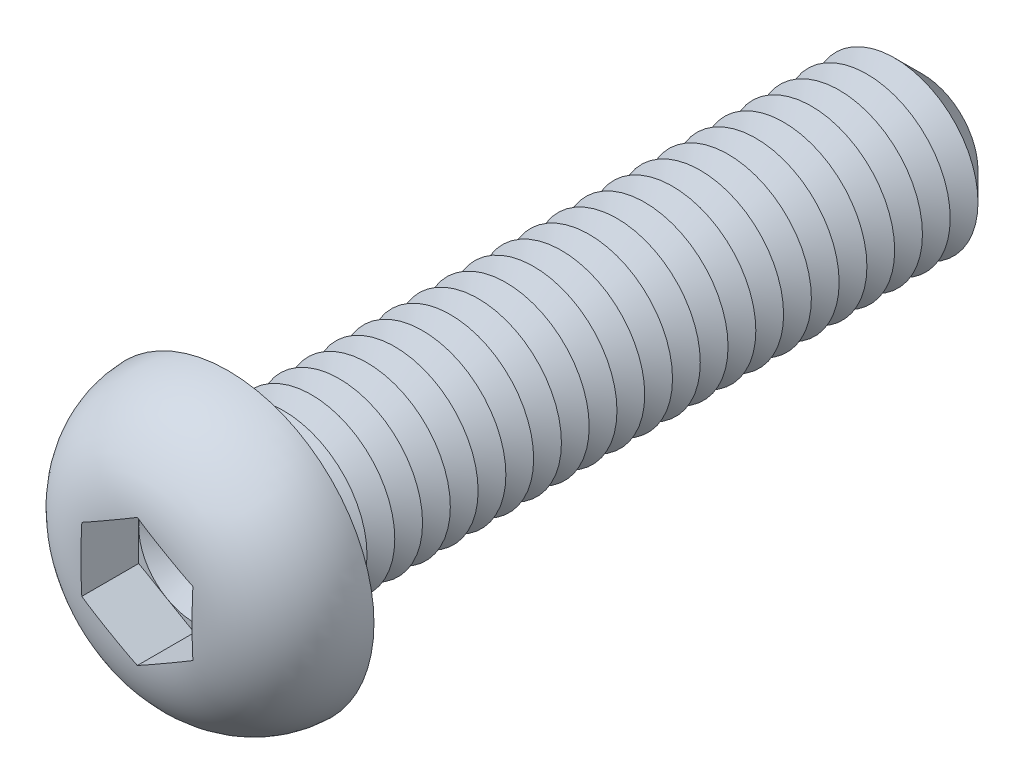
ISO-10303-21;
HEADER;
FILE_DESCRIPTION(('STEP AP214'),'2;1');
FILE_NAME('part.step','',(''),(''),'','','');
FILE_SCHEMA(('AUTOMOTIVE_DESIGN { 1 0 10303 214 1 1 1 1 }'));
ENDSEC;
DATA;
#1=APPLICATION_CONTEXT('core data for automotive mechanical design processes');
#2=APPLICATION_PROTOCOL_DEFINITION('international standard','automotive_design',2000,#1);
#3=PRODUCT_CONTEXT('',#1,'mechanical');
#4=PRODUCT('Part','Part','',(#3));
#5=PRODUCT_RELATED_PRODUCT_CATEGORY('part','',(#4));
#6=PRODUCT_DEFINITION_FORMATION('','',#4);
#7=PRODUCT_DEFINITION_CONTEXT('part definition',#1,'design');
#8=PRODUCT_DEFINITION('design','',#6,#7);
#9=PRODUCT_DEFINITION_SHAPE('','',#8);
#10=(LENGTH_UNIT() NAMED_UNIT(*) SI_UNIT(.MILLI.,.METRE.));
#11=(NAMED_UNIT(*) PLANE_ANGLE_UNIT() SI_UNIT($,.RADIAN.));
#12=(NAMED_UNIT(*) SI_UNIT($,.STERADIAN.) SOLID_ANGLE_UNIT());
#13=UNCERTAINTY_MEASURE_WITH_UNIT(LENGTH_MEASURE(1.E-05),#10,'distance_accuracy_value','');
#14=(GEOMETRIC_REPRESENTATION_CONTEXT(3) GLOBAL_UNCERTAINTY_ASSIGNED_CONTEXT((#13)) GLOBAL_UNIT_ASSIGNED_CONTEXT((#10,
#11,#12)) REPRESENTATION_CONTEXT('',''));
#15=CARTESIAN_POINT('',(0.,0.,0.));
#16=DIRECTION('',(0.,0.,1.));
#17=DIRECTION('',(1.,0.,0.));
#18=AXIS2_PLACEMENT_3D('',#15,#16,#17);
#19=CARTESIAN_POINT('',(0.,0.,1.22));
#20=DIRECTION('',(0.,0.,1.));
#21=DIRECTION('',(1.,0.,0.));
#22=AXIS2_PLACEMENT_3D('',#19,#20,#21);
#23=PLANE('',#22);
#24=CARTESIAN_POINT('',(0.,0.,1.22));
#25=DIRECTION('',(0.,0.,1.));
#26=DIRECTION('',(1.,0.,0.));
#27=AXIS2_PLACEMENT_3D('',#24,#25,#26);
#28=CIRCLE('',#27,2.);
#29=CARTESIAN_POINT('',(2.,0.,1.22));
#30=VERTEX_POINT('',#29);
#31=CARTESIAN_POINT('',(1.,1.73205080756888,1.22));
#32=VERTEX_POINT('',#31);
#33=EDGE_CURVE('E117',#30,#32,#28,.T.);
#34=ORIENTED_EDGE('',*,*,#33,.F.);
#35=DIRECTION('',(0.,1.,0.));
#36=VECTOR('',#35,1.);
#37=CARTESIAN_POINT('',(2.,-1.15470053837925,1.22));
#38=LINE('',#37,#36);
#39=CARTESIAN_POINT('',(2.,1.15470053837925,1.22));
#40=VERTEX_POINT('',#39);
#41=EDGE_CURVE('E140',#30,#40,#38,.T.);
#42=ORIENTED_EDGE('',*,*,#41,.T.);
#43=DIRECTION('',(-0.866025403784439,0.5,0.));
#44=VECTOR('',#43,1.);
#45=CARTESIAN_POINT('',(2.,1.15470053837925,1.22));
#46=LINE('',#45,#44);
#47=EDGE_CURVE('E136',#40,#32,#46,.T.);
#48=ORIENTED_EDGE('',*,*,#47,.T.);
#49=EDGE_LOOP('',(#34,#42,#48));
#50=FACE_BOUND('',#49,.T.);
#51=ADVANCED_FACE('F39',(#50),#23,.T.);
#52=CARTESIAN_POINT('',(0.,0.,1.22));
#53=DIRECTION('',(0.,0.,1.));
#54=DIRECTION('',(1.,0.,0.));
#55=AXIS2_PLACEMENT_3D('',#52,#53,#54);
#56=CIRCLE('',#55,2.);
#57=CARTESIAN_POINT('',(-1.,1.73205080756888,1.22));
#58=VERTEX_POINT('',#57);
#59=EDGE_CURVE('E11',#32,#58,#56,.T.);
#60=ORIENTED_EDGE('',*,*,#59,.F.);
#61=CARTESIAN_POINT('',(0.,2.3094010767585,1.22));
#62=VERTEX_POINT('',#61);
#63=EDGE_CURVE('E130',#32,#62,#46,.T.);
#64=ORIENTED_EDGE('',*,*,#63,.T.);
#65=DIRECTION('',(-0.866025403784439,-0.5,0.));
#66=VECTOR('',#65,1.);
#67=CARTESIAN_POINT('',(0.,2.3094010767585,1.22));
#68=LINE('',#67,#66);
#69=EDGE_CURVE('E131',#62,#58,#68,.T.);
#70=ORIENTED_EDGE('',*,*,#69,.T.);
#71=EDGE_LOOP('',(#60,#64,#70));
#72=FACE_BOUND('',#71,.T.);
#73=ADVANCED_FACE('F129',(#72),#23,.T.);
#74=CARTESIAN_POINT('',(-2.,0.,1.22));
#75=VERTEX_POINT('',#74);
#76=EDGE_CURVE('E49',#58,#75,#56,.T.);
#77=ORIENTED_EDGE('',*,*,#76,.F.);
#78=CARTESIAN_POINT('',(-2.,1.15470053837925,1.22));
#79=VERTEX_POINT('',#78);
#80=EDGE_CURVE('E143',#58,#79,#68,.T.);
#81=ORIENTED_EDGE('',*,*,#80,.T.);
#82=DIRECTION('',(0.,-1.,0.));
#83=VECTOR('',#82,1.);
#84=CARTESIAN_POINT('',(-2.,1.15470053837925,1.22));
#85=LINE('',#84,#83);
#86=EDGE_CURVE('E152',#79,#75,#85,.T.);
#87=ORIENTED_EDGE('',*,*,#86,.T.);
#88=EDGE_LOOP('',(#77,#81,#87));
#89=FACE_BOUND('',#88,.T.);
#90=ADVANCED_FACE('F272',(#89),#23,.T.);
#91=CARTESIAN_POINT('',(-1.,-1.73205080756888,1.22));
#92=VERTEX_POINT('',#91);
#93=EDGE_CURVE('E254',#75,#92,#56,.T.);
#94=ORIENTED_EDGE('',*,*,#93,.F.);
#95=CARTESIAN_POINT('',(-2.,-1.15470053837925,1.22));
#96=VERTEX_POINT('',#95);
#97=EDGE_CURVE('E151',#75,#96,#85,.T.);
#98=ORIENTED_EDGE('',*,*,#97,.T.);
#99=DIRECTION('',(0.866025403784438,-0.5,0.));
#100=VECTOR('',#99,1.);
#101=CARTESIAN_POINT('',(-2.,-1.15470053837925,1.22));
#102=LINE('',#101,#100);
#103=EDGE_CURVE('E157',#96,#92,#102,.T.);
#104=ORIENTED_EDGE('',*,*,#103,.T.);
#105=EDGE_LOOP('',(#94,#98,#104));
#106=FACE_BOUND('',#105,.T.);
#107=ADVANCED_FACE('F266',(#106),#23,.T.);
#108=CARTESIAN_POINT('',(0.999999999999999,-1.73205080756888,1.22));
#109=VERTEX_POINT('',#108);
#110=EDGE_CURVE('E56',#92,#109,#56,.T.);
#111=ORIENTED_EDGE('',*,*,#110,.F.);
#112=CARTESIAN_POINT('',(0.,-2.3094010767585,1.22));
#113=VERTEX_POINT('',#112);
#114=EDGE_CURVE('E156',#92,#113,#102,.T.);
#115=ORIENTED_EDGE('',*,*,#114,.T.);
#116=DIRECTION('',(0.866025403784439,0.5,0.));
#117=VECTOR('',#116,1.);
#118=CARTESIAN_POINT('',(0.,-2.3094010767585,1.22));
#119=LINE('',#118,#117);
#120=EDGE_CURVE('E162',#113,#109,#119,.T.);
#121=ORIENTED_EDGE('',*,*,#120,.T.);
#122=EDGE_LOOP('',(#111,#115,#121));
#123=FACE_BOUND('',#122,.T.);
#124=ADVANCED_FACE('F306',(#123),#23,.T.);
#125=CARTESIAN_POINT('',(0.,0.,-25.));
#126=DIRECTION('',(0.,0.,1.));
#127=DIRECTION('',(1.,0.,0.));
#128=AXIS2_PLACEMENT_3D('',#125,#126,#127);
#129=CYLINDRICAL_SURFACE('',#128,3.);
#130=CARTESIAN_POINT('',(0.,0.,-0.5));
#131=DIRECTION('',(0.,0.,1.));
#132=DIRECTION('',(1.,0.,0.));
#133=AXIS2_PLACEMENT_3D('',#130,#131,#132);
#134=CIRCLE('',#133,3.);
#135=CARTESIAN_POINT('',(3.,0.,-0.5));
#136=VERTEX_POINT('',#135);
#137=EDGE_CURVE('E241',#136,#136,#134,.F.);
#138=ORIENTED_EDGE('',*,*,#137,.T.);
#139=EDGE_LOOP('',(#138));
#140=FACE_BOUND('',#139,.T.);
#141=CARTESIAN_POINT('',(0.,0.,-1.));
#142=DIRECTION('',(0.,0.,1.));
#143=DIRECTION('',(1.,0.,0.));
#144=AXIS2_PLACEMENT_3D('',#141,#142,#143);
#145=CIRCLE('',#144,3.00000000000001);
#146=CARTESIAN_POINT('',(3.00000000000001,0.,-1.));
#147=VERTEX_POINT('',#146);
#148=EDGE_CURVE('E138',#147,#147,#145,.T.);
#149=ORIENTED_EDGE('',*,*,#148,.T.);
#150=EDGE_LOOP('',(#149));
#151=FACE_BOUND('',#150,.T.);
#152=ADVANCED_FACE('F307',(#140,#151),#129,.T.);
#153=CARTESIAN_POINT('',(0.,5.25,0.));
#154=DIRECTION('',(0.,0.,1.));
#155=DIRECTION('',(1.,0.,0.));
#156=AXIS2_PLACEMENT_3D('',#153,#154,#155);
#157=PLANE('',#156);
#158=CARTESIAN_POINT('',(0.,0.,0.));
#159=DIRECTION('',(0.,0.,1.));
#160=DIRECTION('',(1.,0.,0.));
#161=AXIS2_PLACEMENT_3D('',#158,#159,#160);
#162=CIRCLE('',#161,3.5);
#163=CARTESIAN_POINT('',(3.5,0.,0.));
#164=VERTEX_POINT('',#163);
#165=EDGE_CURVE('E244',#164,#164,#162,.T.);
#166=ORIENTED_EDGE('',*,*,#165,.T.);
#167=EDGE_LOOP('',(#166));
#168=FACE_BOUND('',#167,.T.);
#169=CARTESIAN_POINT('',(0.,0.,0.));
#170=DIRECTION('',(0.,0.,1.));
#171=DIRECTION('',(1.,0.,0.));
#172=AXIS2_PLACEMENT_3D('',#169,#170,#171);
#173=CIRCLE('',#172,5.25);
#174=CARTESIAN_POINT('',(5.25,0.,0.));
#175=VERTEX_POINT('',#174);
#176=EDGE_CURVE('E173',#175,#175,#173,.T.);
#177=ORIENTED_EDGE('',*,*,#176,.F.);
#178=EDGE_LOOP('',(#177));
#179=FACE_BOUND('',#178,.T.);
#180=ADVANCED_FACE('F310',(#168,#179),#157,.F.);
#181=CARTESIAN_POINT('',(0.,0.,-0.0999999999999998));
#182=DIRECTION('',(0.,0.,1.));
#183=DIRECTION('',(1.,0.,0.));
#184=AXIS2_PLACEMENT_3D('',#181,#182,#183);
#185=DEGENERATE_TOROIDAL_SURFACE('',#184,1.85147090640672,3.4,.T.);
#186=CARTESIAN_POINT('',(-2.0002,1.15458506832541,3.26900492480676));
#187=CARTESIAN_POINT('',(-1.91694658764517,1.20265144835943,3.27552708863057));
#188=CARTESIAN_POINT('',(-1.83362001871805,1.25076006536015,3.28041849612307));
#189=CARTESIAN_POINT('',(-1.66691146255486,1.34700929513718,3.28784569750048));
#190=CARTESIAN_POINT('',(-1.58352950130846,1.39514989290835,3.29038223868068));
#191=CARTESIAN_POINT('',(-1.4167967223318,1.49141310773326,3.29400753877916));
#192=CARTESIAN_POINT('',(-1.33344591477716,1.5395357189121,3.29509714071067));
#193=CARTESIAN_POINT('',(-1.16673007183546,1.63578915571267,3.29647051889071));
#194=CARTESIAN_POINT('',(-1.08336503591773,1.68391998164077,3.29675420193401));
#195=CARTESIAN_POINT('',(-0.916634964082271,1.78018163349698,3.29675420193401));
#196=CARTESIAN_POINT('',(-0.833269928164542,1.82831245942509,3.29647051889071));
#197=CARTESIAN_POINT('',(-0.666554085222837,1.92456589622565,3.29509714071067));
#198=CARTESIAN_POINT('',(-0.583203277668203,1.9726885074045,3.29400753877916));
#199=CARTESIAN_POINT('',(-0.416470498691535,2.06895172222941,3.29038223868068));
#200=CARTESIAN_POINT('',(-0.333088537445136,2.11709232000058,3.28784569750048));
#201=CARTESIAN_POINT('',(-0.166379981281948,2.21334154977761,3.28041849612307));
#202=CARTESIAN_POINT('',(-0.0830534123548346,2.26145016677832,3.27552708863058));
#203=CARTESIAN_POINT('',(0.000200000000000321,2.30951654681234,3.26900492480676));
#204=B_SPLINE_CURVE_WITH_KNOTS('',3,(#186,#187,#188,#189,#190,#191,#192,#193,#194,#195,#196,
#197,#198,#199,#200,#201,#202,#203),.UNSPECIFIED.,.F.,.F.,(4,2,2,2,2,2,2,2,4),(0.,
0.289010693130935,0.57792963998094,0.866680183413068,1.15546411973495,1.44424805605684,
1.73299859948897,2.02191754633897,2.31092823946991),.UNSPECIFIED.);
#205=CARTESIAN_POINT('',(-2.,1.15470053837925,3.26902062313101));
#206=VERTEX_POINT('',#205);
#207=CARTESIAN_POINT('',(1.70733705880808E-11,2.30940107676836,3.2690206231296));
#208=VERTEX_POINT('',#207);
#209=EDGE_CURVE('E195',#206,#208,#204,.T.);
#210=ORIENTED_EDGE('',*,*,#209,.T.);
#211=CARTESIAN_POINT('',(-0.000199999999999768,2.30951654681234,3.26900492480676));
#212=CARTESIAN_POINT('',(0.0830534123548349,2.26145016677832,3.27552708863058));
#213=CARTESIAN_POINT('',(0.166379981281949,2.21334154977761,3.28041849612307));
#214=CARTESIAN_POINT('',(0.333088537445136,2.11709232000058,3.28784569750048));
#215=CARTESIAN_POINT('',(0.416470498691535,2.06895172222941,3.29038223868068));
#216=CARTESIAN_POINT('',(0.583203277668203,1.9726885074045,3.29400753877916));
#217=CARTESIAN_POINT('',(0.666554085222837,1.92456589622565,3.29509714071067));
#218=CARTESIAN_POINT('',(0.833269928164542,1.82831245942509,3.29647051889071));
#219=CARTESIAN_POINT('',(0.916634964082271,1.78018163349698,3.29675420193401));
#220=CARTESIAN_POINT('',(1.08336503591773,1.68391998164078,3.29675420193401));
#221=CARTESIAN_POINT('',(1.16673007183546,1.63578915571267,3.29647051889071));
#222=CARTESIAN_POINT('',(1.33344591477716,1.5395357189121,3.29509714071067));
#223=CARTESIAN_POINT('',(1.4167967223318,1.49141310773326,3.29400753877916));
#224=CARTESIAN_POINT('',(1.58352950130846,1.39514989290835,3.29038223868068));
#225=CARTESIAN_POINT('',(1.66691146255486,1.34700929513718,3.28784569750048));
#226=CARTESIAN_POINT('',(1.83362001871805,1.25076006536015,3.28041849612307));
#227=CARTESIAN_POINT('',(1.91694658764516,1.20265144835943,3.27552708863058));
#228=CARTESIAN_POINT('',(2.0002,1.15458506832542,3.26900492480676));
#229=B_SPLINE_CURVE_WITH_KNOTS('',3,(#211,#212,#213,#214,#215,#216,#217,#218,#219,#220,#221,
#222,#223,#224,#225,#226,#227,#228),.UNSPECIFIED.,.F.,.F.,(4,2,2,2,2,2,2,2,4),(0.,
0.289010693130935,0.577929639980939,0.866680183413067,1.15546411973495,1.44424805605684,
1.73299859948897,2.02191754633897,2.31092823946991),.UNSPECIFIED.);
#230=CARTESIAN_POINT('',(2.,1.15470053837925,3.26902062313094));
#231=VERTEX_POINT('',#230);
#232=EDGE_CURVE('E224',#208,#231,#229,.T.);
#233=ORIENTED_EDGE('',*,*,#232,.T.);
#234=CARTESIAN_POINT('',(2.,0.,3.29675420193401));
#235=CARTESIAN_POINT('',(2.,-0.0838690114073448,3.29675159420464));
#236=CARTESIAN_POINT('',(2.,-0.167737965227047,3.29653427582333));
#237=CARTESIAN_POINT('',(2.,-0.335473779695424,3.29552217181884));
#238=CARTESIAN_POINT('',(2.,-0.419340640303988,3.29472737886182));
#239=CARTESIAN_POINT('',(2.,-0.587092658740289,3.29218243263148));
#240=CARTESIAN_POINT('',(2.,-0.670977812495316,3.29043194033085));
#241=CARTESIAN_POINT('',(2.,-0.838702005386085,3.28542814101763));
#242=CARTESIAN_POINT('',(2.,-0.922541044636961,3.28217483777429));
#243=CARTESIAN_POINT('',(2.,-1.173343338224,3.26923984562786));
#244=CARTESIAN_POINT('',(2.,-1.34017699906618,3.25638268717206));
#245=CARTESIAN_POINT('',(2.,-1.67225876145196,3.21731215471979));
#246=CARTESIAN_POINT('',(2.,-1.83750825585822,3.19111187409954));
#247=CARTESIAN_POINT('',(2.,-2.10571503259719,3.13417573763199));
#248=CARTESIAN_POINT('',(2.,-2.20973442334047,3.10844622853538));
#249=CARTESIAN_POINT('',(2.,-2.41562153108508,3.04936015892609));
#250=CARTESIAN_POINT('',(2.,-2.51748898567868,3.01600267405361));
#251=CARTESIAN_POINT('',(2.,-2.71832295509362,2.94120377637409));
#252=CARTESIAN_POINT('',(2.,-2.81728700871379,2.89975572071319));
#253=CARTESIAN_POINT('',(2.,-3.01134256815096,2.80859624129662));
#254=CARTESIAN_POINT('',(2.,-3.10643425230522,2.75888519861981));
#255=CARTESIAN_POINT('',(2.,-3.29253530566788,2.65079509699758));
#256=CARTESIAN_POINT('',(2.,-3.38350832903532,2.59235327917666));
#257=CARTESIAN_POINT('',(2.,-3.55964478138,2.46728791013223));
#258=CARTESIAN_POINT('',(2.,-3.64480873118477,2.40066509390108));
#259=CARTESIAN_POINT('',(2.,-3.80840353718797,2.25961603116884));
#260=CARTESIAN_POINT('',(2.,-3.88683504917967,2.18519054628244));
#261=CARTESIAN_POINT('',(2.,-4.03608847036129,2.02906828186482));
#262=CARTESIAN_POINT('',(2.,-4.106911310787,1.94737239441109));
#263=CARTESIAN_POINT('',(2.,-4.23287471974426,1.78665318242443));
#264=CARTESIAN_POINT('',(2.,-4.2888832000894,1.7083085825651));
#265=CARTESIAN_POINT('',(2.,-4.39372062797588,1.54691061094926));
#266=CARTESIAN_POINT('',(2.,-4.44254705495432,1.46385560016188));
#267=CARTESIAN_POINT('',(2.,-4.53249771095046,1.29375158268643));
#268=CARTESIAN_POINT('',(2.,-4.57362814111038,1.20670586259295));
#269=CARTESIAN_POINT('',(2.,-4.6478549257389,1.02924414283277));
#270=CARTESIAN_POINT('',(2.,-4.68094842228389,0.938826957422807));
#271=CARTESIAN_POINT('',(2.,-4.76413649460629,0.674747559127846));
#272=CARTESIAN_POINT('',(2.,-4.80368573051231,0.497625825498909));
#273=CARTESIAN_POINT('',(2.,-4.85179982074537,0.13932226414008));
#274=CARTESIAN_POINT('',(2.,-4.86036774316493,-0.0418591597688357));
#275=CARTESIAN_POINT('',(2.,-4.84642577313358,-0.399473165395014));
#276=CARTESIAN_POINT('',(2.,-4.82452156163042,-0.575929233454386));
#277=CARTESIAN_POINT('',(2.,-4.75142809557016,-0.922615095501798));
#278=CARTESIAN_POINT('',(2.,-4.70024536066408,-1.09284626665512));
#279=CARTESIAN_POINT('',(2.,-4.57020203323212,-1.42258491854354));
#280=CARTESIAN_POINT('',(2.,-4.49131097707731,-1.58208036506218));
#281=CARTESIAN_POINT('',(2.,-4.3083542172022,-1.8860021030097));
#282=CARTESIAN_POINT('',(2.,-4.2042742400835,-2.03041978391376));
#283=CARTESIAN_POINT('',(2.,-3.97174533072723,-2.30354399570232));
#284=CARTESIAN_POINT('',(2.,-3.84281347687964,-2.43183812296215));
#285=CARTESIAN_POINT('',(2.,-3.56631740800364,-2.66612298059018));
#286=CARTESIAN_POINT('',(2.,-3.41877418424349,-2.77213848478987));
#287=CARTESIAN_POINT('',(2.,-3.18261597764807,-2.91604941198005));
#288=CARTESIAN_POINT('',(2.,-3.09905663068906,-2.96247915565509));
#289=CARTESIAN_POINT('',(2.,-2.92856838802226,-3.04879370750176));
#290=CARTESIAN_POINT('',(2.,-2.84163827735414,-3.08867612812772));
#291=CARTESIAN_POINT('',(2.,-2.66495003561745,-3.16199567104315));
#292=CARTESIAN_POINT('',(2.,-2.57518752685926,-3.19542218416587));
#293=CARTESIAN_POINT('',(2.,-2.3936698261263,-3.25594506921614));
#294=CARTESIAN_POINT('',(2.,-2.30191676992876,-3.28304789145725));
#295=CARTESIAN_POINT('',(2.,-2.07265810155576,-3.34285611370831));
#296=CARTESIAN_POINT('',(2.,-1.93423373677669,-3.37205334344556));
#297=CARTESIAN_POINT('',(2.,-1.65546420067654,-3.419280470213));
#298=CARTESIAN_POINT('',(2.,-1.51511762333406,-3.43730169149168));
#299=CARTESIAN_POINT('',(2.,-1.23291689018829,-3.46473877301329));
#300=CARTESIAN_POINT('',(2.,-1.09105869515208,-3.47411015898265));
#301=CARTESIAN_POINT('',(2.,-0.807138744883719,-3.48717303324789));
#302=CARTESIAN_POINT('',(2.,-0.665077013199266,-3.4908651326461));
#303=CARTESIAN_POINT('',(2.,-0.451303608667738,-3.49429675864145));
#304=CARTESIAN_POINT('',(2.,-0.379602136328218,-3.49508825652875));
#305=CARTESIAN_POINT('',(2.,-0.236195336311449,-3.49619580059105));
#306=CARTESIAN_POINT('',(2.,-0.164490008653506,-3.49651184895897));
#307=CARTESIAN_POINT('',(2.,-0.0210718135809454,-3.49680708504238));
#308=CARTESIAN_POINT('',(2.,0.0506410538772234,-3.49678623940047));
#309=CARTESIAN_POINT('',(2.,0.194065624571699,-3.49639104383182));
#310=CARTESIAN_POINT('',(2.,0.265777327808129,-3.49601669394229));
#311=CARTESIAN_POINT('',(2.,0.480501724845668,-3.4941697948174));
#312=CARTESIAN_POINT('',(2.,0.623510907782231,-3.49197539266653));
#313=CARTESIAN_POINT('',(2.,0.909378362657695,-3.48318258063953));
#314=CARTESIAN_POINT('',(2.,1.05223667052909,-3.47658576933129));
#315=CARTESIAN_POINT('',(2.,1.30726724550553,-3.45800282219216));
#316=CARTESIAN_POINT('',(2.,1.41953767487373,-3.44745204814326));
#317=CARTESIAN_POINT('',(2.,1.64336701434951,-3.42020385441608));
#318=CARTESIAN_POINT('',(2.,1.75492585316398,-3.40350582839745));
#319=CARTESIAN_POINT('',(2.,1.97590795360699,-3.36293007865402));
#320=CARTESIAN_POINT('',(2.,2.08534088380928,-3.33910600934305));
#321=CARTESIAN_POINT('',(2.,2.30216001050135,-3.28336687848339));
#322=CARTESIAN_POINT('',(2.,2.40954602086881,-3.25145108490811));
#323=CARTESIAN_POINT('',(2.,2.62289868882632,-3.1784271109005));
#324=CARTESIAN_POINT('',(2.,2.72882262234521,-3.13719314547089));
#325=CARTESIAN_POINT('',(2.,2.93660837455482,-3.04548652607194));
#326=CARTESIAN_POINT('',(2.,3.03847031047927,-2.99501413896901));
#327=CARTESIAN_POINT('',(2.,3.23738754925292,-2.88459171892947));
#328=CARTESIAN_POINT('',(2.,3.33442546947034,-2.82461027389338));
#329=CARTESIAN_POINT('',(2.,3.52225616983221,-2.69545434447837));
#330=CARTESIAN_POINT('',(2.,3.61304636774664,-2.62627609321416));
#331=CARTESIAN_POINT('',(2.,3.77958578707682,-2.48563135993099));
#332=CARTESIAN_POINT('',(2.,3.85595570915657,-2.41489922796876));
#333=CARTESIAN_POINT('',(2.,4.00175744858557,-2.26661746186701));
#334=CARTESIAN_POINT('',(2.,4.07118992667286,-2.18906847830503));
#335=CARTESIAN_POINT('',(2.,4.20228235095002,-2.02784942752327));
#336=CARTESIAN_POINT('',(2.,4.26395450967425,-1.94418931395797));
#337=CARTESIAN_POINT('',(2.,4.37897455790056,-1.7713710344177));
#338=CARTESIAN_POINT('',(2.,4.43232318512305,-1.68221335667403));
#339=CARTESIAN_POINT('',(2.,4.5685109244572,-1.42722170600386));
#340=CARTESIAN_POINT('',(2.,4.64167742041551,-1.25607726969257));
#341=CARTESIAN_POINT('',(2.,4.75695354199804,-0.903699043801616));
#342=CARTESIAN_POINT('',(2.,4.79906366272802,-0.722465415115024));
#343=CARTESIAN_POINT('',(2.,4.84982785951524,-0.362243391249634));
#344=CARTESIAN_POINT('',(2.,4.85966759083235,-0.183422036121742));
#345=CARTESIAN_POINT('',(2.,4.84889099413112,0.17327689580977));
#346=CARTESIAN_POINT('',(2.,4.82827907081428,0.351154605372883));
#347=CARTESIAN_POINT('',(2.,4.75760776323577,0.699332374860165));
#348=CARTESIAN_POINT('',(2.,4.70780624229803,0.869684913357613));
#349=CARTESIAN_POINT('',(2.,4.58058971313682,1.199716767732));
#350=CARTESIAN_POINT('',(2.,4.50317623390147,1.35939667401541));
#351=CARTESIAN_POINT('',(2.,4.32230037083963,1.66542907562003));
#352=CARTESIAN_POINT('',(2.,4.21858077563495,1.81162931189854));
#353=CARTESIAN_POINT('',(2.,3.98879583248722,2.08527000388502));
#354=CARTESIAN_POINT('',(2.,3.86272429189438,2.21270524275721));
#355=CARTESIAN_POINT('',(2.,3.58743550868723,2.45020985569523));
#356=CARTESIAN_POINT('',(2.,3.43756474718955,2.55951924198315));
#357=CARTESIAN_POINT('',(2.,3.12282273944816,2.7535430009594));
#358=CARTESIAN_POINT('',(2.,2.95795742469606,2.83826704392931));
#359=CARTESIAN_POINT('',(2.,2.67096435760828,2.96064273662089));
#360=CARTESIAN_POINT('',(2.,2.55150855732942,3.00473766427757));
#361=CARTESIAN_POINT('',(2.,2.30905936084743,3.08191633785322));
#362=CARTESIAN_POINT('',(2.,2.18606487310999,3.11499664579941));
#363=CARTESIAN_POINT('',(2.,1.93761764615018,3.17114962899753));
#364=CARTESIAN_POINT('',(2.,1.8121607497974,3.19420352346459));
#365=CARTESIAN_POINT('',(2.,1.56000755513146,3.23170431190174));
#366=CARTESIAN_POINT('',(2.,1.43331126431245,3.24615125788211));
#367=CARTESIAN_POINT('',(2.,1.19785080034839,3.26676473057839));
#368=CARTESIAN_POINT('',(2.,1.08915974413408,3.27383022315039));
#369=CARTESIAN_POINT('',(2.,0.87159878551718,3.28448481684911));
#370=CARTESIAN_POINT('',(2.,0.762728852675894,3.28807324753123));
#371=CARTESIAN_POINT('',(2.,0.54488171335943,3.29312180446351));
#372=CARTESIAN_POINT('',(2.,0.435904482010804,3.29458062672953));
#373=CARTESIAN_POINT('',(2.,0.217951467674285,3.29639847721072));
#374=CARTESIAN_POINT('',(2.,0.108975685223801,3.29675759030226));
#375=CARTESIAN_POINT('',(2.,0.,3.29675420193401));
#376=B_SPLINE_CURVE_WITH_KNOTS('',3,(#234,#235,#236,#237,#238,#239,#240,#241,#242,#243,#244,
#245,#246,#247,#248,#249,#250,#251,#252,#253,#254,#255,#256,#257,#258,#259,#260,#261,#262,#263,
#264,#265,#266,#267,#268,#269,#270,#271,#272,#273,#274,#275,#276,#277,#278,#279,#280,#281,#282,
#283,#284,#285,#286,#287,#288,#289,#290,#291,#292,#293,#294,#295,#296,#297,#298,#299,#300,#301,
#302,#303,#304,#305,#306,#307,#308,#309,#310,#311,#312,#313,#314,#315,#316,#317,#318,#319,#320,
#321,#322,#323,#324,#325,#326,#327,#328,#329,#330,#331,#332,#333,#334,#335,#336,#337,#338,#339,
#340,#341,#342,#343,#344,#345,#346,#347,#348,#349,#350,#351,#352,#353,#354,#355,#356,#357,#358,
#359,#360,#361,#362,#363,#364,#365,#366,#367,#368,#369,#370,#371,#372,#373,#374,#375),
.UNSPECIFIED.,.T.,.F.,(4,2,2,2,2,2,2,2,2,2,2,2,2,2,2,2,2,2,2,2,2,2,2,2,2,2,2,2,2,2,2,2,2,2,2,2,
2,2,2,2,2,2,2,2,2,2,2,2,2,2,2,2,2,2,2,2,2,2,2,2,2,2,2,2,2,2,2,2,2,2,4),(0.,0.251606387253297,
0.503215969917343,0.754914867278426,1.00661313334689,1.50825543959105,2.00940643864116,
2.33061510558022,2.65186271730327,2.97337521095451,3.29487288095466,3.61880390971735,
3.94270585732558,4.26657621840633,4.59040689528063,4.8789527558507,5.16759964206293,
5.45601293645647,5.74452864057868,6.28608750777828,6.82759274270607,7.35848716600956,
7.8892634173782,8.42062506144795,8.95228851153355,9.49557283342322,10.0382497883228,
10.3247866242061,10.6114277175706,10.8985359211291,11.1853499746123,11.6091713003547,
12.0333212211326,12.4596400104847,12.8859129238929,13.1010304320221,13.316146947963,
13.5312847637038,13.746422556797,14.1754765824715,14.6043748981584,14.9425387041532,
15.2807358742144,15.6164481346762,15.9521907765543,16.2927694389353,16.6333382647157,
16.9750565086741,17.3169151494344,17.6287548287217,17.9405647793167,18.2518777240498,
18.5631630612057,19.1185081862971,19.6738444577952,20.20853386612,20.7431459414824,
21.2731049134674,21.8030345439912,22.3383600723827,22.8738341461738,23.4279697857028,
23.9818871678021,24.3633752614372,24.7449823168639,25.1273011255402,25.5096176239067,
25.8363061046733,26.163057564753,26.4900090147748,26.8169352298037),.UNSPECIFIED.);
#377=CARTESIAN_POINT('',(2.,-1.15470053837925,3.26902062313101));
#378=VERTEX_POINT('',#377);
#379=EDGE_CURVE('E233',#231,#378,#376,.T.);
#380=ORIENTED_EDGE('',*,*,#379,.T.);
#381=CARTESIAN_POINT('',(2.0002,-1.15458506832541,3.26900492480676));
#382=CARTESIAN_POINT('',(1.91694658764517,-1.20265144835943,3.27552708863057));
#383=CARTESIAN_POINT('',(1.83362001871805,-1.25076006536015,3.28041849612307));
#384=CARTESIAN_POINT('',(1.66691146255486,-1.34700929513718,3.28784569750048));
#385=CARTESIAN_POINT('',(1.58352950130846,-1.39514989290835,3.29038223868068));
#386=CARTESIAN_POINT('',(1.4167967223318,-1.49141310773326,3.29400753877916));
#387=CARTESIAN_POINT('',(1.33344591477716,-1.5395357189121,3.29509714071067));
#388=CARTESIAN_POINT('',(1.16673007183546,-1.63578915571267,3.29647051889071));
#389=CARTESIAN_POINT('',(1.08336503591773,-1.68391998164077,3.29675420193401));
#390=CARTESIAN_POINT('',(0.916634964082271,-1.78018163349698,3.29675420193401));
#391=CARTESIAN_POINT('',(0.833269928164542,-1.82831245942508,3.29647051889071));
#392=CARTESIAN_POINT('',(0.666554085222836,-1.92456589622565,3.29509714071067));
#393=CARTESIAN_POINT('',(0.583203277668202,-1.97268850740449,3.29400753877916));
#394=CARTESIAN_POINT('',(0.416470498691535,-2.06895172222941,3.29038223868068));
#395=CARTESIAN_POINT('',(0.333088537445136,-2.11709232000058,3.28784569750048));
#396=CARTESIAN_POINT('',(0.166379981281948,-2.2133415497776,3.28041849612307));
#397=CARTESIAN_POINT('',(0.0830534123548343,-2.26145016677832,3.27552708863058));
#398=CARTESIAN_POINT('',(-0.000200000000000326,-2.30951654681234,3.26900492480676));
#399=B_SPLINE_CURVE_WITH_KNOTS('',3,(#381,#382,#383,#384,#385,#386,#387,#388,#389,#390,#391,
#392,#393,#394,#395,#396,#397,#398),.UNSPECIFIED.,.F.,.F.,(4,2,2,2,2,2,2,2,4),(0.,
0.289010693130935,0.57792963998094,0.866680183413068,1.15546411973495,1.44424805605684,
1.73299859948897,2.02191754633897,2.31092823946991),.UNSPECIFIED.);
#400=CARTESIAN_POINT('',(0.,-2.3094010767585,3.26902062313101));
#401=VERTEX_POINT('',#400);
#402=EDGE_CURVE('E281',#378,#401,#399,.T.);
#403=ORIENTED_EDGE('',*,*,#402,.T.);
#404=CARTESIAN_POINT('',(0.000199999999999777,-2.30951654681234,3.26900492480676));
#405=CARTESIAN_POINT('',(-0.083053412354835,-2.26145016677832,3.27552708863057));
#406=CARTESIAN_POINT('',(-0.166379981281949,-2.21334154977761,3.28041849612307));
#407=CARTESIAN_POINT('',(-0.333088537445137,-2.11709232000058,3.28784569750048));
#408=CARTESIAN_POINT('',(-0.416470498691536,-2.06895172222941,3.29038223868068));
#409=CARTESIAN_POINT('',(-0.583203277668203,-1.97268850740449,3.29400753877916));
#410=CARTESIAN_POINT('',(-0.666554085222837,-1.92456589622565,3.29509714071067));
#411=CARTESIAN_POINT('',(-0.833269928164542,-1.82831245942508,3.29647051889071));
#412=CARTESIAN_POINT('',(-0.916634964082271,-1.78018163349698,3.29675420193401));
#413=CARTESIAN_POINT('',(-1.08336503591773,-1.68391998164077,3.29675420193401));
#414=CARTESIAN_POINT('',(-1.16673007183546,-1.63578915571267,3.29647051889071));
#415=CARTESIAN_POINT('',(-1.33344591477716,-1.5395357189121,3.29509714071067));
#416=CARTESIAN_POINT('',(-1.4167967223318,-1.49141310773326,3.29400753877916));
#417=CARTESIAN_POINT('',(-1.58352950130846,-1.39514989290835,3.29038223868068));
#418=CARTESIAN_POINT('',(-1.66691146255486,-1.34700929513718,3.28784569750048));
#419=CARTESIAN_POINT('',(-1.83362001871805,-1.25076006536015,3.28041849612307));
#420=CARTESIAN_POINT('',(-1.91694658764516,-1.20265144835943,3.27552708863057));
#421=CARTESIAN_POINT('',(-2.0002,-1.15458506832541,3.26900492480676));
#422=B_SPLINE_CURVE_WITH_KNOTS('',3,(#404,#405,#406,#407,#408,#409,#410,#411,#412,#413,#414,
#415,#416,#417,#418,#419,#420,#421),.UNSPECIFIED.,.F.,.F.,(4,2,2,2,2,2,2,2,4),(0.,
0.289010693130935,0.577929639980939,0.866680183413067,1.15546411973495,1.44424805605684,
1.73299859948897,2.02191754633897,2.31092823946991),.UNSPECIFIED.);
#423=CARTESIAN_POINT('',(-2.,-1.15470053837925,3.26902062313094));
#424=VERTEX_POINT('',#423);
#425=EDGE_CURVE('E279',#401,#424,#422,.T.);
#426=ORIENTED_EDGE('',*,*,#425,.T.);
#427=CARTESIAN_POINT('',(-2.,0.,3.29675420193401));
#428=CARTESIAN_POINT('',(-2.,0.0838690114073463,3.29675159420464));
#429=CARTESIAN_POINT('',(-2.,0.167737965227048,3.29653427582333));
#430=CARTESIAN_POINT('',(-2.,0.335473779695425,3.29552217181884));
#431=CARTESIAN_POINT('',(-2.,0.41934064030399,3.29472737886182));
#432=CARTESIAN_POINT('',(-2.,0.58709265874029,3.29218243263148));
#433=CARTESIAN_POINT('',(-2.,0.670977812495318,3.29043194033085));
#434=CARTESIAN_POINT('',(-2.,0.838702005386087,3.28542814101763));
#435=CARTESIAN_POINT('',(-2.,0.922541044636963,3.28217483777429));
#436=CARTESIAN_POINT('',(-2.,1.173343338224,3.26923984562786));
#437=CARTESIAN_POINT('',(-2.,1.34017699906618,3.25638268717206));
#438=CARTESIAN_POINT('',(-2.,1.67225876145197,3.21731215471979));
#439=CARTESIAN_POINT('',(-2.,1.83750825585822,3.19111187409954));
#440=CARTESIAN_POINT('',(-2.,2.10571503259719,3.13417573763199));
#441=CARTESIAN_POINT('',(-2.,2.20973442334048,3.10844622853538));
#442=CARTESIAN_POINT('',(-2.,2.41562153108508,3.04936015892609));
#443=CARTESIAN_POINT('',(-2.,2.51748898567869,3.01600267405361));
#444=CARTESIAN_POINT('',(-2.,2.71832295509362,2.94120377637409));
#445=CARTESIAN_POINT('',(-2.,2.81728700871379,2.89975572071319));
#446=CARTESIAN_POINT('',(-2.,3.01134256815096,2.80859624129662));
#447=CARTESIAN_POINT('',(-2.,3.10643425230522,2.75888519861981));
#448=CARTESIAN_POINT('',(-2.,3.29253530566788,2.65079509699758));
#449=CARTESIAN_POINT('',(-2.,3.38350832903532,2.59235327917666));
#450=CARTESIAN_POINT('',(-2.,3.55964478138,2.46728791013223));
#451=CARTESIAN_POINT('',(-2.,3.64480873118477,2.40066509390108));
#452=CARTESIAN_POINT('',(-2.,3.80840353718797,2.25961603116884));
#453=CARTESIAN_POINT('',(-2.,3.88683504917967,2.18519054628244));
#454=CARTESIAN_POINT('',(-2.,4.03608847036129,2.02906828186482));
#455=CARTESIAN_POINT('',(-2.,4.106911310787,1.94737239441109));
#456=CARTESIAN_POINT('',(-2.,4.23287471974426,1.78665318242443));
#457=CARTESIAN_POINT('',(-2.,4.2888832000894,1.7083085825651));
#458=CARTESIAN_POINT('',(-2.,4.39372062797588,1.54691061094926));
#459=CARTESIAN_POINT('',(-2.,4.44254705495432,1.46385560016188));
#460=CARTESIAN_POINT('',(-2.,4.53249771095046,1.29375158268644));
#461=CARTESIAN_POINT('',(-2.,4.57362814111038,1.20670586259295));
#462=CARTESIAN_POINT('',(-2.,4.6478549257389,1.02924414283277));
#463=CARTESIAN_POINT('',(-2.,4.68094842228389,0.938826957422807));
#464=CARTESIAN_POINT('',(-2.,4.76413649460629,0.674747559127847));
#465=CARTESIAN_POINT('',(-2.,4.80368573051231,0.497625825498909));
#466=CARTESIAN_POINT('',(-2.,4.85179982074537,0.13932226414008));
#467=CARTESIAN_POINT('',(-2.,4.86036774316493,-0.0418591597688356));
#468=CARTESIAN_POINT('',(-2.,4.84642577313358,-0.399473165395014));
#469=CARTESIAN_POINT('',(-2.,4.82452156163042,-0.575929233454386));
#470=CARTESIAN_POINT('',(-2.,4.75142809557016,-0.922615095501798));
#471=CARTESIAN_POINT('',(-2.,4.70024536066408,-1.09284626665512));
#472=CARTESIAN_POINT('',(-2.,4.57020203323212,-1.42258491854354));
#473=CARTESIAN_POINT('',(-2.,4.49131097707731,-1.58208036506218));
#474=CARTESIAN_POINT('',(-2.,4.3083542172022,-1.8860021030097));
#475=CARTESIAN_POINT('',(-2.,4.2042742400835,-2.03041978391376));
#476=CARTESIAN_POINT('',(-2.,3.97174533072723,-2.30354399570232));
#477=CARTESIAN_POINT('',(-2.,3.84281347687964,-2.43183812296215));
#478=CARTESIAN_POINT('',(-2.,3.56631740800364,-2.66612298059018));
#479=CARTESIAN_POINT('',(-2.,3.41877418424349,-2.77213848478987));
#480=CARTESIAN_POINT('',(-2.,3.18261597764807,-2.91604941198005));
#481=CARTESIAN_POINT('',(-2.,3.09905663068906,-2.96247915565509));
#482=CARTESIAN_POINT('',(-2.,2.92856838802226,-3.04879370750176));
#483=CARTESIAN_POINT('',(-2.,2.84163827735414,-3.08867612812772));
#484=CARTESIAN_POINT('',(-2.,2.66495003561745,-3.16199567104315));
#485=CARTESIAN_POINT('',(-2.,2.57518752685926,-3.19542218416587));
#486=CARTESIAN_POINT('',(-2.,2.3936698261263,-3.25594506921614));
#487=CARTESIAN_POINT('',(-2.,2.30191676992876,-3.28304789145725));
#488=CARTESIAN_POINT('',(-2.,2.07265810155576,-3.34285611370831));
#489=CARTESIAN_POINT('',(-2.,1.93423373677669,-3.37205334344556));
#490=CARTESIAN_POINT('',(-2.,1.65546420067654,-3.419280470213));
#491=CARTESIAN_POINT('',(-2.,1.51511762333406,-3.43730169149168));
#492=CARTESIAN_POINT('',(-2.,1.23291689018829,-3.46473877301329));
#493=CARTESIAN_POINT('',(-2.,1.09105869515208,-3.47411015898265));
#494=CARTESIAN_POINT('',(-2.,0.807138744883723,-3.48717303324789));
#495=CARTESIAN_POINT('',(-2.,0.66507701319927,-3.4908651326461));
#496=CARTESIAN_POINT('',(-2.,0.451303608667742,-3.49429675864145));
#497=CARTESIAN_POINT('',(-2.,0.379602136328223,-3.49508825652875));
#498=CARTESIAN_POINT('',(-2.,0.236195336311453,-3.49619580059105));
#499=CARTESIAN_POINT('',(-2.,0.16449000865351,-3.49651184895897));
#500=CARTESIAN_POINT('',(-2.,0.0210718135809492,-3.49680708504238));
#501=CARTESIAN_POINT('',(-2.,-0.0506410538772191,-3.49678623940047));
#502=CARTESIAN_POINT('',(-2.,-0.194065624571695,-3.49639104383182));
#503=CARTESIAN_POINT('',(-2.,-0.265777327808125,-3.49601669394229));
#504=CARTESIAN_POINT('',(-2.,-0.480501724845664,-3.4941697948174));
#505=CARTESIAN_POINT('',(-2.,-0.623510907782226,-3.49197539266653));
#506=CARTESIAN_POINT('',(-2.,-0.909378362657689,-3.48318258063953));
#507=CARTESIAN_POINT('',(-2.,-1.05223667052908,-3.47658576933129));
#508=CARTESIAN_POINT('',(-2.,-1.30726724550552,-3.45800282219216));
#509=CARTESIAN_POINT('',(-2.,-1.41953767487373,-3.44745204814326));
#510=CARTESIAN_POINT('',(-2.,-1.6433670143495,-3.42020385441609));
#511=CARTESIAN_POINT('',(-2.,-1.75492585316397,-3.40350582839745));
#512=CARTESIAN_POINT('',(-2.,-1.97590795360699,-3.36293007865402));
#513=CARTESIAN_POINT('',(-2.,-2.08534088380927,-3.33910600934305));
#514=CARTESIAN_POINT('',(-2.,-2.30216001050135,-3.28336687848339));
#515=CARTESIAN_POINT('',(-2.,-2.4095460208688,-3.25145108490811));
#516=CARTESIAN_POINT('',(-2.,-2.62289868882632,-3.1784271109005));
#517=CARTESIAN_POINT('',(-2.,-2.72882262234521,-3.13719314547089));
#518=CARTESIAN_POINT('',(-2.,-2.93660837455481,-3.04548652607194));
#519=CARTESIAN_POINT('',(-2.,-3.03847031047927,-2.99501413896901));
#520=CARTESIAN_POINT('',(-2.,-3.23738754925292,-2.88459171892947));
#521=CARTESIAN_POINT('',(-2.,-3.33442546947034,-2.82461027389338));
#522=CARTESIAN_POINT('',(-2.,-3.52225616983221,-2.69545434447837));
#523=CARTESIAN_POINT('',(-2.,-3.61304636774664,-2.62627609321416));
#524=CARTESIAN_POINT('',(-2.,-3.77958578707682,-2.48563135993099));
#525=CARTESIAN_POINT('',(-2.,-3.85595570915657,-2.41489922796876));
#526=CARTESIAN_POINT('',(-2.,-4.00175744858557,-2.26661746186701));
#527=CARTESIAN_POINT('',(-2.,-4.07118992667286,-2.18906847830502));
#528=CARTESIAN_POINT('',(-2.,-4.20228235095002,-2.02784942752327));
#529=CARTESIAN_POINT('',(-2.,-4.26395450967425,-1.94418931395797));
#530=CARTESIAN_POINT('',(-2.,-4.37897455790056,-1.7713710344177));
#531=CARTESIAN_POINT('',(-2.,-4.43232318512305,-1.68221335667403));
#532=CARTESIAN_POINT('',(-2.,-4.5685109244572,-1.42722170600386));
#533=CARTESIAN_POINT('',(-2.,-4.64167742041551,-1.25607726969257));
#534=CARTESIAN_POINT('',(-2.,-4.75695354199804,-0.903699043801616));
#535=CARTESIAN_POINT('',(-2.,-4.79906366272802,-0.722465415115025));
#536=CARTESIAN_POINT('',(-2.,-4.84982785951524,-0.362243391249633));
#537=CARTESIAN_POINT('',(-2.,-4.85966759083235,-0.18342203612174));
#538=CARTESIAN_POINT('',(-2.,-4.84889099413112,0.173276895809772));
#539=CARTESIAN_POINT('',(-2.,-4.82827907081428,0.351154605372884));
#540=CARTESIAN_POINT('',(-2.,-4.75760776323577,0.699332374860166));
#541=CARTESIAN_POINT('',(-2.,-4.70780624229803,0.869684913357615));
#542=CARTESIAN_POINT('',(-2.,-4.58058971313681,1.199716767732));
#543=CARTESIAN_POINT('',(-2.,-4.50317623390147,1.35939667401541));
#544=CARTESIAN_POINT('',(-2.,-4.32230037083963,1.66542907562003));
#545=CARTESIAN_POINT('',(-2.,-4.21858077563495,1.81162931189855));
#546=CARTESIAN_POINT('',(-2.,-3.98879583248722,2.08527000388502));
#547=CARTESIAN_POINT('',(-2.,-3.86272429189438,2.21270524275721));
#548=CARTESIAN_POINT('',(-2.,-3.58743550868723,2.45020985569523));
#549=CARTESIAN_POINT('',(-2.,-3.43756474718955,2.55951924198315));
#550=CARTESIAN_POINT('',(-2.,-3.12282273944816,2.7535430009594));
#551=CARTESIAN_POINT('',(-2.,-2.95795742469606,2.8382670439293));
#552=CARTESIAN_POINT('',(-2.,-2.67096435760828,2.96064273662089));
#553=CARTESIAN_POINT('',(-2.,-2.55150855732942,3.00473766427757));
#554=CARTESIAN_POINT('',(-2.,-2.30905936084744,3.08191633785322));
#555=CARTESIAN_POINT('',(-2.,-2.18606487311,3.11499664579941));
#556=CARTESIAN_POINT('',(-2.,-1.93761764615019,3.17114962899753));
#557=CARTESIAN_POINT('',(-2.,-1.81216074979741,3.19420352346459));
#558=CARTESIAN_POINT('',(-2.,-1.56000755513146,3.23170431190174));
#559=CARTESIAN_POINT('',(-2.,-1.43331126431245,3.24615125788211));
#560=CARTESIAN_POINT('',(-2.,-1.19785080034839,3.26676473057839));
#561=CARTESIAN_POINT('',(-2.,-1.08915974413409,3.27383022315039));
#562=CARTESIAN_POINT('',(-2.,-0.871598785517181,3.28448481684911));
#563=CARTESIAN_POINT('',(-2.,-0.762728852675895,3.28807324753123));
#564=CARTESIAN_POINT('',(-2.,-0.54488171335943,3.29312180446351));
#565=CARTESIAN_POINT('',(-2.,-0.435904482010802,3.29458062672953));
#566=CARTESIAN_POINT('',(-2.,-0.217951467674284,3.29639847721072));
#567=CARTESIAN_POINT('',(-2.,-0.108975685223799,3.29675759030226));
#568=CARTESIAN_POINT('',(-2.,0.,3.29675420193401));
#569=B_SPLINE_CURVE_WITH_KNOTS('',3,(#427,#428,#429,#430,#431,#432,#433,#434,#435,#436,#437,
#438,#439,#440,#441,#442,#443,#444,#445,#446,#447,#448,#449,#450,#451,#452,#453,#454,#455,#456,
#457,#458,#459,#460,#461,#462,#463,#464,#465,#466,#467,#468,#469,#470,#471,#472,#473,#474,#475,
#476,#477,#478,#479,#480,#481,#482,#483,#484,#485,#486,#487,#488,#489,#490,#491,#492,#493,#494,
#495,#496,#497,#498,#499,#500,#501,#502,#503,#504,#505,#506,#507,#508,#509,#510,#511,#512,#513,
#514,#515,#516,#517,#518,#519,#520,#521,#522,#523,#524,#525,#526,#527,#528,#529,#530,#531,#532,
#533,#534,#535,#536,#537,#538,#539,#540,#541,#542,#543,#544,#545,#546,#547,#548,#549,#550,#551,
#552,#553,#554,#555,#556,#557,#558,#559,#560,#561,#562,#563,#564,#565,#566,#567,#568),
.UNSPECIFIED.,.T.,.F.,(4,2,2,2,2,2,2,2,2,2,2,2,2,2,2,2,2,2,2,2,2,2,2,2,2,2,2,2,2,2,2,2,2,2,2,2,
2,2,2,2,2,2,2,2,2,2,2,2,2,2,2,2,2,2,2,2,2,2,2,2,2,2,2,2,2,2,2,2,2,2,4),(0.,0.251606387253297,
0.503215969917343,0.754914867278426,1.0066131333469,1.50825543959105,2.00940643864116,
2.33061510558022,2.65186271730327,2.97337521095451,3.29487288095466,3.61880390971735,
3.94270585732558,4.26657621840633,4.59040689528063,4.8789527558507,5.16759964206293,
5.45601293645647,5.74452864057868,6.28608750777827,6.82759274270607,7.35848716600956,
7.88926341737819,8.42062506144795,8.95228851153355,9.49557283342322,10.0382497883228,
10.3247866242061,10.6114277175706,10.8985359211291,11.1853499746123,11.6091713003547,
12.0333212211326,12.4596400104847,12.8859129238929,13.1010304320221,13.316146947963,
13.5312847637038,13.746422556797,14.1754765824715,14.6043748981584,14.9425387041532,
15.2807358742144,15.6164481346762,15.9521907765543,16.2927694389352,16.6333382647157,
16.9750565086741,17.3169151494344,17.6287548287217,17.9405647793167,18.2518777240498,
18.5631630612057,19.1185081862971,19.6738444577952,20.20853386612,20.7431459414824,
21.2731049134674,21.8030345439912,22.3383600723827,22.8738341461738,23.4279697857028,
23.981887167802,24.3633752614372,24.7449823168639,25.1273011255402,25.5096176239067,
25.8363061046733,26.163057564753,26.4900090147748,26.8169352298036),.UNSPECIFIED.);
#570=EDGE_CURVE('E204',#424,#206,#569,.T.);
#571=ORIENTED_EDGE('',*,*,#570,.T.);
#572=EDGE_LOOP('',(#210,#233,#380,#403,#426,#571));
#573=FACE_BOUND('',#572,.T.);
#574=ORIENTED_EDGE('',*,*,#176,.T.);
#575=EDGE_LOOP('',(#574));
#576=FACE_BOUND('',#575,.T.);
#577=ADVANCED_FACE('F209',(#573,#576),#185,.T.);
#578=CARTESIAN_POINT('',(2.,1.15470053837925,1.22));
#579=DIRECTION('',(0.5,0.866025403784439,0.));
#580=DIRECTION('',(-0.866025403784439,0.5,0.));
#581=AXIS2_PLACEMENT_3D('',#578,#579,#580);
#582=PLANE('',#581);
#583=DIRECTION('',(0.,0.,1.));
#584=VECTOR('',#583,1.);
#585=CARTESIAN_POINT('',(0.,2.3094010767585,1.22));
#586=LINE('',#585,#584);
#587=EDGE_CURVE('E64',#62,#208,#586,.T.);
#588=ORIENTED_EDGE('',*,*,#587,.F.);
#589=ORIENTED_EDGE('',*,*,#63,.F.);
#590=ORIENTED_EDGE('',*,*,#47,.F.);
#591=DIRECTION('',(0.,0.,1.));
#592=VECTOR('',#591,1.);
#593=CARTESIAN_POINT('',(2.,1.15470053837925,1.22));
#594=LINE('',#593,#592);
#595=EDGE_CURVE('E170',#40,#231,#594,.T.);
#596=ORIENTED_EDGE('',*,*,#595,.T.);
#597=ORIENTED_EDGE('',*,*,#232,.F.);
#598=EDGE_LOOP('',(#588,#589,#590,#596,#597));
#599=FACE_BOUND('',#598,.T.);
#600=ADVANCED_FACE('F134',(#599),#582,.F.);
#601=CARTESIAN_POINT('',(2.,-1.15470053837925,1.22));
#602=DIRECTION('',(1.,0.,0.));
#603=DIRECTION('',(0.,1.,0.));
#604=AXIS2_PLACEMENT_3D('',#601,#602,#603);
#605=PLANE('',#604);
#606=ORIENTED_EDGE('',*,*,#595,.F.);
#607=ORIENTED_EDGE('',*,*,#41,.F.);
#608=CARTESIAN_POINT('',(2.,-1.15470053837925,1.22));
#609=VERTEX_POINT('',#608);
#610=EDGE_CURVE('E166',#609,#30,#38,.T.);
#611=ORIENTED_EDGE('',*,*,#610,.F.);
#612=DIRECTION('',(0.,0.,1.));
#613=VECTOR('',#612,1.);
#614=CARTESIAN_POINT('',(2.,-1.15470053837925,1.22));
#615=LINE('',#614,#613);
#616=EDGE_CURVE('E174',#609,#378,#615,.T.);
#617=ORIENTED_EDGE('',*,*,#616,.T.);
#618=ORIENTED_EDGE('',*,*,#379,.F.);
#619=EDGE_LOOP('',(#606,#607,#611,#617,#618));
#620=FACE_BOUND('',#619,.T.);
#621=ADVANCED_FACE('F222',(#620),#605,.F.);
#622=CARTESIAN_POINT('',(0.,-2.3094010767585,1.22));
#623=DIRECTION('',(0.5,-0.866025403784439,0.));
#624=DIRECTION('',(0.866025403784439,0.5,0.));
#625=AXIS2_PLACEMENT_3D('',#622,#623,#624);
#626=PLANE('',#625);
#627=ORIENTED_EDGE('',*,*,#616,.F.);
#628=EDGE_CURVE('E161',#109,#609,#119,.T.);
#629=ORIENTED_EDGE('',*,*,#628,.F.);
#630=ORIENTED_EDGE('',*,*,#120,.F.);
#631=DIRECTION('',(0.,0.,1.));
#632=VECTOR('',#631,1.);
#633=CARTESIAN_POINT('',(0.,-2.3094010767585,1.22));
#634=LINE('',#633,#632);
#635=EDGE_CURVE('E178',#113,#401,#634,.T.);
#636=ORIENTED_EDGE('',*,*,#635,.T.);
#637=ORIENTED_EDGE('',*,*,#402,.F.);
#638=EDGE_LOOP('',(#627,#629,#630,#636,#637));
#639=FACE_BOUND('',#638,.T.);
#640=ADVANCED_FACE('F293',(#639),#626,.F.);
#641=CARTESIAN_POINT('',(-2.,-1.15470053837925,1.22));
#642=DIRECTION('',(-0.5,-0.866025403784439,0.));
#643=DIRECTION('',(0.866025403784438,-0.5,0.));
#644=AXIS2_PLACEMENT_3D('',#641,#642,#643);
#645=PLANE('',#644);
#646=ORIENTED_EDGE('',*,*,#635,.F.);
#647=ORIENTED_EDGE('',*,*,#114,.F.);
#648=ORIENTED_EDGE('',*,*,#103,.F.);
#649=DIRECTION('',(0.,0.,1.));
#650=VECTOR('',#649,1.);
#651=CARTESIAN_POINT('',(-2.,-1.15470053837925,1.22));
#652=LINE('',#651,#650);
#653=EDGE_CURVE('E182',#96,#424,#652,.T.);
#654=ORIENTED_EDGE('',*,*,#653,.T.);
#655=ORIENTED_EDGE('',*,*,#425,.F.);
#656=EDGE_LOOP('',(#646,#647,#648,#654,#655));
#657=FACE_BOUND('',#656,.T.);
#658=ADVANCED_FACE('F290',(#657),#645,.F.);
#659=CARTESIAN_POINT('',(-2.,1.15470053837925,1.22));
#660=DIRECTION('',(-1.,0.,0.));
#661=DIRECTION('',(0.,-1.,0.));
#662=AXIS2_PLACEMENT_3D('',#659,#660,#661);
#663=PLANE('',#662);
#664=ORIENTED_EDGE('',*,*,#653,.F.);
#665=ORIENTED_EDGE('',*,*,#97,.F.);
#666=ORIENTED_EDGE('',*,*,#86,.F.);
#667=DIRECTION('',(0.,0.,1.));
#668=VECTOR('',#667,1.);
#669=CARTESIAN_POINT('',(-2.,1.15470053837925,1.22));
#670=LINE('',#669,#668);
#671=EDGE_CURVE('E186',#79,#206,#670,.T.);
#672=ORIENTED_EDGE('',*,*,#671,.T.);
#673=ORIENTED_EDGE('',*,*,#570,.F.);
#674=EDGE_LOOP('',(#664,#665,#666,#672,#673));
#675=FACE_BOUND('',#674,.T.);
#676=ADVANCED_FACE('F217',(#675),#663,.F.);
#677=CARTESIAN_POINT('',(0.,2.3094010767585,1.22));
#678=DIRECTION('',(-0.5,0.866025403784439,0.));
#679=DIRECTION('',(-0.866025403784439,-0.5,0.));
#680=AXIS2_PLACEMENT_3D('',#677,#678,#679);
#681=PLANE('',#680);
#682=ORIENTED_EDGE('',*,*,#671,.F.);
#683=ORIENTED_EDGE('',*,*,#80,.F.);
#684=ORIENTED_EDGE('',*,*,#69,.F.);
#685=ORIENTED_EDGE('',*,*,#587,.T.);
#686=ORIENTED_EDGE('',*,*,#209,.F.);
#687=EDGE_LOOP('',(#682,#683,#684,#685,#686));
#688=FACE_BOUND('',#687,.T.);
#689=ADVANCED_FACE('F213',(#688),#681,.F.);
#690=EDGE_CURVE('E43',#109,#30,#56,.T.);
#691=ORIENTED_EDGE('',*,*,#690,.F.);
#692=ORIENTED_EDGE('',*,*,#628,.T.);
#693=ORIENTED_EDGE('',*,*,#610,.T.);
#694=EDGE_LOOP('',(#691,#692,#693));
#695=FACE_BOUND('',#694,.T.);
#696=ADVANCED_FACE('F216',(#695),#23,.T.);
#697=CARTESIAN_POINT('',(0.,0.,-1.));
#698=DIRECTION('',(0.,0.,1.));
#699=DIRECTION('',(1.,0.,0.));
#700=AXIS2_PLACEMENT_3D('',#697,#698,#699);
#701=CONICAL_SURFACE('',#700,3.00000000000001,1.0471975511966);
#702=CARTESIAN_POINT('',(0.,0.,-1.5));
#703=DIRECTION('',(0.,0.,1.));
#704=DIRECTION('',(1.,0.,0.));
#705=AXIS2_PLACEMENT_3D('',#702,#703,#704);
#706=CIRCLE('',#705,2.13397459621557);
#707=CARTESIAN_POINT('',(2.13397459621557,0.,-1.5));
#708=VERTEX_POINT('',#707);
#709=EDGE_CURVE('E571',#708,#708,#706,.T.);
#710=ORIENTED_EDGE('',*,*,#709,.T.);
#711=EDGE_LOOP('',(#710));
#712=FACE_BOUND('',#711,.T.);
#713=ORIENTED_EDGE('',*,*,#148,.F.);
#714=EDGE_LOOP('',(#713));
#715=FACE_BOUND('',#714,.T.);
#716=ADVANCED_FACE('F304',(#712,#715),#701,.T.);
#717=CARTESIAN_POINT('',(0.,0.,-1.5));
#718=DIRECTION('',(0.,0.,-1.));
#719=DIRECTION('',(-1.,0.,0.));
#720=AXIS2_PLACEMENT_3D('',#717,#718,#719);
#721=CONICAL_SURFACE('',#720,2.13397459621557,1.0471975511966);
#722=CARTESIAN_POINT('',(0.,0.,-2.));
#723=DIRECTION('',(0.,0.,1.));
#724=DIRECTION('',(1.,0.,0.));
#725=AXIS2_PLACEMENT_3D('',#722,#723,#724);
#726=CIRCLE('',#725,3.00000000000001);
#727=CARTESIAN_POINT('',(3.00000000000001,0.,-2.));
#728=VERTEX_POINT('',#727);
#729=EDGE_CURVE('E565',#728,#728,#726,.T.);
#730=ORIENTED_EDGE('',*,*,#729,.T.);
#731=EDGE_LOOP('',(#730));
#732=FACE_BOUND('',#731,.T.);
#733=ORIENTED_EDGE('',*,*,#709,.F.);
#734=EDGE_LOOP('',(#733));
#735=FACE_BOUND('',#734,.T.);
#736=ADVANCED_FACE('F320',(#732,#735),#721,.T.);
#737=CARTESIAN_POINT('',(0.,0.,-2.));
#738=DIRECTION('',(0.,0.,1.));
#739=DIRECTION('',(1.,0.,0.));
#740=AXIS2_PLACEMENT_3D('',#737,#738,#739);
#741=CONICAL_SURFACE('',#740,3.00000000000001,1.0471975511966);
#742=CARTESIAN_POINT('',(0.,0.,-2.5));
#743=DIRECTION('',(0.,0.,1.));
#744=DIRECTION('',(1.,0.,0.));
#745=AXIS2_PLACEMENT_3D('',#742,#743,#744);
#746=CIRCLE('',#745,2.13397459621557);
#747=CARTESIAN_POINT('',(2.13397459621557,0.,-2.5));
#748=VERTEX_POINT('',#747);
#749=EDGE_CURVE('E563',#748,#748,#746,.T.);
#750=ORIENTED_EDGE('',*,*,#749,.T.);
#751=EDGE_LOOP('',(#750));
#752=FACE_BOUND('',#751,.T.);
#753=ORIENTED_EDGE('',*,*,#729,.F.);
#754=EDGE_LOOP('',(#753));
#755=FACE_BOUND('',#754,.T.);
#756=ADVANCED_FACE('F324',(#752,#755),#741,.T.);
#757=CARTESIAN_POINT('',(0.,0.,-2.5));
#758=DIRECTION('',(0.,0.,-1.));
#759=DIRECTION('',(-1.,0.,0.));
#760=AXIS2_PLACEMENT_3D('',#757,#758,#759);
#761=CONICAL_SURFACE('',#760,2.13397459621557,1.0471975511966);
#762=CARTESIAN_POINT('',(0.,0.,-3.));
#763=DIRECTION('',(0.,0.,1.));
#764=DIRECTION('',(1.,0.,0.));
#765=AXIS2_PLACEMENT_3D('',#762,#763,#764);
#766=CIRCLE('',#765,3.00000000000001);
#767=CARTESIAN_POINT('',(3.00000000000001,0.,-3.));
#768=VERTEX_POINT('',#767);
#769=EDGE_CURVE('E566',#768,#768,#766,.T.);
#770=ORIENTED_EDGE('',*,*,#769,.T.);
#771=EDGE_LOOP('',(#770));
#772=FACE_BOUND('',#771,.T.);
#773=ORIENTED_EDGE('',*,*,#749,.F.);
#774=EDGE_LOOP('',(#773));
#775=FACE_BOUND('',#774,.T.);
#776=ADVANCED_FACE('F328',(#772,#775),#761,.T.);
#777=CARTESIAN_POINT('',(0.,0.,-3.));
#778=DIRECTION('',(0.,0.,1.));
#779=DIRECTION('',(1.,0.,0.));
#780=AXIS2_PLACEMENT_3D('',#777,#778,#779);
#781=CONICAL_SURFACE('',#780,3.00000000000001,1.0471975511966);
#782=CARTESIAN_POINT('',(0.,0.,-3.5));
#783=DIRECTION('',(0.,0.,1.));
#784=DIRECTION('',(1.,0.,0.));
#785=AXIS2_PLACEMENT_3D('',#782,#783,#784);
#786=CIRCLE('',#785,2.13397459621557);
#787=CARTESIAN_POINT('',(2.13397459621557,0.,-3.5));
#788=VERTEX_POINT('',#787);
#789=EDGE_CURVE('E586',#788,#788,#786,.T.);
#790=ORIENTED_EDGE('',*,*,#789,.T.);
#791=EDGE_LOOP('',(#790));
#792=FACE_BOUND('',#791,.T.);
#793=ORIENTED_EDGE('',*,*,#769,.F.);
#794=EDGE_LOOP('',(#793));
#795=FACE_BOUND('',#794,.T.);
#796=ADVANCED_FACE('F332',(#792,#795),#781,.T.);
#797=CARTESIAN_POINT('',(0.,0.,-3.5));
#798=DIRECTION('',(0.,0.,-1.));
#799=DIRECTION('',(-1.,0.,0.));
#800=AXIS2_PLACEMENT_3D('',#797,#798,#799);
#801=CONICAL_SURFACE('',#800,2.13397459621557,1.0471975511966);
#802=CARTESIAN_POINT('',(0.,0.,-4.));
#803=DIRECTION('',(0.,0.,1.));
#804=DIRECTION('',(1.,0.,0.));
#805=AXIS2_PLACEMENT_3D('',#802,#803,#804);
#806=CIRCLE('',#805,3.00000000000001);
#807=CARTESIAN_POINT('',(3.00000000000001,0.,-4.));
#808=VERTEX_POINT('',#807);
#809=EDGE_CURVE('E584',#808,#808,#806,.T.);
#810=ORIENTED_EDGE('',*,*,#809,.T.);
#811=EDGE_LOOP('',(#810));
#812=FACE_BOUND('',#811,.T.);
#813=ORIENTED_EDGE('',*,*,#789,.F.);
#814=EDGE_LOOP('',(#813));
#815=FACE_BOUND('',#814,.T.);
#816=ADVANCED_FACE('F336',(#812,#815),#801,.T.);
#817=CARTESIAN_POINT('',(0.,0.,-4.));
#818=DIRECTION('',(0.,0.,1.));
#819=DIRECTION('',(1.,0.,0.));
#820=AXIS2_PLACEMENT_3D('',#817,#818,#819);
#821=CONICAL_SURFACE('',#820,3.00000000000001,1.0471975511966);
#822=CARTESIAN_POINT('',(0.,0.,-4.5));
#823=DIRECTION('',(0.,0.,1.));
#824=DIRECTION('',(1.,0.,0.));
#825=AXIS2_PLACEMENT_3D('',#822,#823,#824);
#826=CIRCLE('',#825,2.13397459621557);
#827=CARTESIAN_POINT('',(2.13397459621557,0.,-4.5));
#828=VERTEX_POINT('',#827);
#829=EDGE_CURVE('E587',#828,#828,#826,.T.);
#830=ORIENTED_EDGE('',*,*,#829,.T.);
#831=EDGE_LOOP('',(#830));
#832=FACE_BOUND('',#831,.T.);
#833=ORIENTED_EDGE('',*,*,#809,.F.);
#834=EDGE_LOOP('',(#833));
#835=FACE_BOUND('',#834,.T.);
#836=ADVANCED_FACE('F340',(#832,#835),#821,.T.);
#837=CARTESIAN_POINT('',(0.,0.,-4.5));
#838=DIRECTION('',(0.,0.,-1.));
#839=DIRECTION('',(-1.,0.,0.));
#840=AXIS2_PLACEMENT_3D('',#837,#838,#839);
#841=CONICAL_SURFACE('',#840,2.13397459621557,1.0471975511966);
#842=CARTESIAN_POINT('',(0.,0.,-5.));
#843=DIRECTION('',(0.,0.,1.));
#844=DIRECTION('',(1.,0.,0.));
#845=AXIS2_PLACEMENT_3D('',#842,#843,#844);
#846=CIRCLE('',#845,3.00000000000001);
#847=CARTESIAN_POINT('',(3.00000000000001,0.,-5.));
#848=VERTEX_POINT('',#847);
#849=EDGE_CURVE('E524',#848,#848,#846,.T.);
#850=ORIENTED_EDGE('',*,*,#849,.T.);
#851=EDGE_LOOP('',(#850));
#852=FACE_BOUND('',#851,.T.);
#853=ORIENTED_EDGE('',*,*,#829,.F.);
#854=EDGE_LOOP('',(#853));
#855=FACE_BOUND('',#854,.T.);
#856=ADVANCED_FACE('F344',(#852,#855),#841,.T.);
#857=CARTESIAN_POINT('',(0.,0.,-5.));
#858=DIRECTION('',(0.,0.,1.));
#859=DIRECTION('',(1.,0.,0.));
#860=AXIS2_PLACEMENT_3D('',#857,#858,#859);
#861=CONICAL_SURFACE('',#860,3.00000000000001,1.0471975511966);
#862=CARTESIAN_POINT('',(0.,0.,-5.5));
#863=DIRECTION('',(0.,0.,1.));
#864=DIRECTION('',(1.,0.,0.));
#865=AXIS2_PLACEMENT_3D('',#862,#863,#864);
#866=CIRCLE('',#865,2.13397459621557);
#867=CARTESIAN_POINT('',(2.13397459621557,0.,-5.5));
#868=VERTEX_POINT('',#867);
#869=EDGE_CURVE('E636',#868,#868,#866,.T.);
#870=ORIENTED_EDGE('',*,*,#869,.T.);
#871=EDGE_LOOP('',(#870));
#872=FACE_BOUND('',#871,.T.);
#873=ORIENTED_EDGE('',*,*,#849,.F.);
#874=EDGE_LOOP('',(#873));
#875=FACE_BOUND('',#874,.T.);
#876=ADVANCED_FACE('F348',(#872,#875),#861,.T.);
#877=CARTESIAN_POINT('',(0.,0.,-5.5));
#878=DIRECTION('',(0.,0.,-1.));
#879=DIRECTION('',(-1.,0.,0.));
#880=AXIS2_PLACEMENT_3D('',#877,#878,#879);
#881=CONICAL_SURFACE('',#880,2.13397459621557,1.0471975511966);
#882=CARTESIAN_POINT('',(0.,0.,-6.));
#883=DIRECTION('',(0.,0.,1.));
#884=DIRECTION('',(1.,0.,0.));
#885=AXIS2_PLACEMENT_3D('',#882,#883,#884);
#886=CIRCLE('',#885,3.00000000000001);
#887=CARTESIAN_POINT('',(3.00000000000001,0.,-6.));
#888=VERTEX_POINT('',#887);
#889=EDGE_CURVE('E541',#888,#888,#886,.T.);
#890=ORIENTED_EDGE('',*,*,#889,.T.);
#891=EDGE_LOOP('',(#890));
#892=FACE_BOUND('',#891,.T.);
#893=ORIENTED_EDGE('',*,*,#869,.F.);
#894=EDGE_LOOP('',(#893));
#895=FACE_BOUND('',#894,.T.);
#896=ADVANCED_FACE('F352',(#892,#895),#881,.T.);
#897=CARTESIAN_POINT('',(0.,0.,-6.));
#898=DIRECTION('',(0.,0.,1.));
#899=DIRECTION('',(1.,0.,0.));
#900=AXIS2_PLACEMENT_3D('',#897,#898,#899);
#901=CONICAL_SURFACE('',#900,3.00000000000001,1.0471975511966);
#902=CARTESIAN_POINT('',(0.,0.,-6.5));
#903=DIRECTION('',(0.,0.,1.));
#904=DIRECTION('',(1.,0.,0.));
#905=AXIS2_PLACEMENT_3D('',#902,#903,#904);
#906=CIRCLE('',#905,2.13397459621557);
#907=CARTESIAN_POINT('',(2.13397459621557,0.,-6.5));
#908=VERTEX_POINT('',#907);
#909=EDGE_CURVE('E539',#908,#908,#906,.T.);
#910=ORIENTED_EDGE('',*,*,#909,.T.);
#911=EDGE_LOOP('',(#910));
#912=FACE_BOUND('',#911,.T.);
#913=ORIENTED_EDGE('',*,*,#889,.F.);
#914=EDGE_LOOP('',(#913));
#915=FACE_BOUND('',#914,.T.);
#916=ADVANCED_FACE('F356',(#912,#915),#901,.T.);
#917=CARTESIAN_POINT('',(0.,0.,-6.5));
#918=DIRECTION('',(0.,0.,-1.));
#919=DIRECTION('',(-1.,0.,0.));
#920=AXIS2_PLACEMENT_3D('',#917,#918,#919);
#921=CONICAL_SURFACE('',#920,2.13397459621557,1.0471975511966);
#922=CARTESIAN_POINT('',(0.,0.,-7.));
#923=DIRECTION('',(0.,0.,1.));
#924=DIRECTION('',(1.,0.,0.));
#925=AXIS2_PLACEMENT_3D('',#922,#923,#924);
#926=CIRCLE('',#925,3.00000000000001);
#927=CARTESIAN_POINT('',(3.00000000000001,0.,-7.));
#928=VERTEX_POINT('',#927);
#929=EDGE_CURVE('E542',#928,#928,#926,.T.);
#930=ORIENTED_EDGE('',*,*,#929,.T.);
#931=EDGE_LOOP('',(#930));
#932=FACE_BOUND('',#931,.T.);
#933=ORIENTED_EDGE('',*,*,#909,.F.);
#934=EDGE_LOOP('',(#933));
#935=FACE_BOUND('',#934,.T.);
#936=ADVANCED_FACE('F360',(#932,#935),#921,.T.);
#937=CARTESIAN_POINT('',(0.,0.,-7.));
#938=DIRECTION('',(0.,0.,1.));
#939=DIRECTION('',(1.,0.,0.));
#940=AXIS2_PLACEMENT_3D('',#937,#938,#939);
#941=CONICAL_SURFACE('',#940,3.00000000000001,1.0471975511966);
#942=CARTESIAN_POINT('',(0.,0.,-7.5));
#943=DIRECTION('',(0.,0.,1.));
#944=DIRECTION('',(1.,0.,0.));
#945=AXIS2_PLACEMENT_3D('',#942,#943,#944);
#946=CIRCLE('',#945,2.13397459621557);
#947=CARTESIAN_POINT('',(2.13397459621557,0.,-7.5));
#948=VERTEX_POINT('',#947);
#949=EDGE_CURVE('E560',#948,#948,#946,.T.);
#950=ORIENTED_EDGE('',*,*,#949,.T.);
#951=EDGE_LOOP('',(#950));
#952=FACE_BOUND('',#951,.T.);
#953=ORIENTED_EDGE('',*,*,#929,.F.);
#954=EDGE_LOOP('',(#953));
#955=FACE_BOUND('',#954,.T.);
#956=ADVANCED_FACE('F364',(#952,#955),#941,.T.);
#957=CARTESIAN_POINT('',(0.,0.,-7.5));
#958=DIRECTION('',(0.,0.,-1.));
#959=DIRECTION('',(-1.,0.,0.));
#960=AXIS2_PLACEMENT_3D('',#957,#958,#959);
#961=CONICAL_SURFACE('',#960,2.13397459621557,1.0471975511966);
#962=CARTESIAN_POINT('',(0.,0.,-8.));
#963=DIRECTION('',(0.,0.,1.));
#964=DIRECTION('',(1.,0.,0.));
#965=AXIS2_PLACEMENT_3D('',#962,#963,#964);
#966=CIRCLE('',#965,3.00000000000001);
#967=CARTESIAN_POINT('',(3.00000000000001,0.,-8.));
#968=VERTEX_POINT('',#967);
#969=EDGE_CURVE('E557',#968,#968,#966,.T.);
#970=ORIENTED_EDGE('',*,*,#969,.T.);
#971=EDGE_LOOP('',(#970));
#972=FACE_BOUND('',#971,.T.);
#973=ORIENTED_EDGE('',*,*,#949,.F.);
#974=EDGE_LOOP('',(#973));
#975=FACE_BOUND('',#974,.T.);
#976=ADVANCED_FACE('F368',(#972,#975),#961,.T.);
#977=CARTESIAN_POINT('',(0.,0.,-8.));
#978=DIRECTION('',(0.,0.,1.));
#979=DIRECTION('',(1.,0.,0.));
#980=AXIS2_PLACEMENT_3D('',#977,#978,#979);
#981=CONICAL_SURFACE('',#980,3.00000000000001,1.0471975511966);
#982=CARTESIAN_POINT('',(0.,0.,-8.5));
#983=DIRECTION('',(0.,0.,1.));
#984=DIRECTION('',(1.,0.,0.));
#985=AXIS2_PLACEMENT_3D('',#982,#983,#984);
#986=CIRCLE('',#985,2.13397459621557);
#987=CARTESIAN_POINT('',(2.13397459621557,0.,-8.5));
#988=VERTEX_POINT('',#987);
#989=EDGE_CURVE('E561',#988,#988,#986,.T.);
#990=ORIENTED_EDGE('',*,*,#989,.T.);
#991=EDGE_LOOP('',(#990));
#992=FACE_BOUND('',#991,.T.);
#993=ORIENTED_EDGE('',*,*,#969,.F.);
#994=EDGE_LOOP('',(#993));
#995=FACE_BOUND('',#994,.T.);
#996=ADVANCED_FACE('F372',(#992,#995),#981,.T.);
#997=CARTESIAN_POINT('',(0.,0.,-8.5));
#998=DIRECTION('',(0.,0.,-1.));
#999=DIRECTION('',(-1.,0.,0.));
#1000=AXIS2_PLACEMENT_3D('',#997,#998,#999);
#1001=CONICAL_SURFACE('',#1000,2.13397459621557,1.0471975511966);
#1002=CARTESIAN_POINT('',(0.,0.,-9.));
#1003=DIRECTION('',(0.,0.,1.));
#1004=DIRECTION('',(1.,0.,0.));
#1005=AXIS2_PLACEMENT_3D('',#1002,#1003,#1004);
#1006=CIRCLE('',#1005,3.00000000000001);
#1007=CARTESIAN_POINT('',(3.00000000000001,0.,-9.));
#1008=VERTEX_POINT('',#1007);
#1009=EDGE_CURVE('E576',#1008,#1008,#1006,.T.);
#1010=ORIENTED_EDGE('',*,*,#1009,.T.);
#1011=EDGE_LOOP('',(#1010));
#1012=FACE_BOUND('',#1011,.T.);
#1013=ORIENTED_EDGE('',*,*,#989,.F.);
#1014=EDGE_LOOP('',(#1013));
#1015=FACE_BOUND('',#1014,.T.);
#1016=ADVANCED_FACE('F376',(#1012,#1015),#1001,.T.);
#1017=CARTESIAN_POINT('',(0.,0.,-9.));
#1018=DIRECTION('',(0.,0.,1.));
#1019=DIRECTION('',(1.,0.,0.));
#1020=AXIS2_PLACEMENT_3D('',#1017,#1018,#1019);
#1021=CONICAL_SURFACE('',#1020,3.00000000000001,1.0471975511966);
#1022=CARTESIAN_POINT('',(0.,0.,-9.5));
#1023=DIRECTION('',(0.,0.,1.));
#1024=DIRECTION('',(1.,0.,0.));
#1025=AXIS2_PLACEMENT_3D('',#1022,#1023,#1024);
#1026=CIRCLE('',#1025,2.13397459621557);
#1027=CARTESIAN_POINT('',(2.13397459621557,0.,-9.5));
#1028=VERTEX_POINT('',#1027);
#1029=EDGE_CURVE('E579',#1028,#1028,#1026,.T.);
#1030=ORIENTED_EDGE('',*,*,#1029,.T.);
#1031=EDGE_LOOP('',(#1030));
#1032=FACE_BOUND('',#1031,.T.);
#1033=ORIENTED_EDGE('',*,*,#1009,.F.);
#1034=EDGE_LOOP('',(#1033));
#1035=FACE_BOUND('',#1034,.T.);
#1036=ADVANCED_FACE('F380',(#1032,#1035),#1021,.T.);
#1037=CARTESIAN_POINT('',(0.,0.,-9.5));
#1038=DIRECTION('',(0.,0.,-1.));
#1039=DIRECTION('',(-1.,0.,0.));
#1040=AXIS2_PLACEMENT_3D('',#1037,#1038,#1039);
#1041=CONICAL_SURFACE('',#1040,2.13397459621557,1.0471975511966);
#1042=CARTESIAN_POINT('',(0.,0.,-10.));
#1043=DIRECTION('',(0.,0.,1.));
#1044=DIRECTION('',(1.,0.,0.));
#1045=AXIS2_PLACEMENT_3D('',#1042,#1043,#1044);
#1046=CIRCLE('',#1045,3.00000000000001);
#1047=CARTESIAN_POINT('',(3.00000000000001,0.,-10.));
#1048=VERTEX_POINT('',#1047);
#1049=EDGE_CURVE('E620',#1048,#1048,#1046,.T.);
#1050=ORIENTED_EDGE('',*,*,#1049,.T.);
#1051=EDGE_LOOP('',(#1050));
#1052=FACE_BOUND('',#1051,.T.);
#1053=ORIENTED_EDGE('',*,*,#1029,.F.);
#1054=EDGE_LOOP('',(#1053));
#1055=FACE_BOUND('',#1054,.T.);
#1056=ADVANCED_FACE('F384',(#1052,#1055),#1041,.T.);
#1057=CARTESIAN_POINT('',(0.,0.,-10.));
#1058=DIRECTION('',(0.,0.,1.));
#1059=DIRECTION('',(1.,0.,0.));
#1060=AXIS2_PLACEMENT_3D('',#1057,#1058,#1059);
#1061=CONICAL_SURFACE('',#1060,3.00000000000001,1.0471975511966);
#1062=CARTESIAN_POINT('',(0.,0.,-10.5));
#1063=DIRECTION('',(0.,0.,1.));
#1064=DIRECTION('',(1.,0.,0.));
#1065=AXIS2_PLACEMENT_3D('',#1062,#1063,#1064);
#1066=CIRCLE('',#1065,2.13397459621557);
#1067=CARTESIAN_POINT('',(2.13397459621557,0.,-10.5));
#1068=VERTEX_POINT('',#1067);
#1069=EDGE_CURVE('E616',#1068,#1068,#1066,.T.);
#1070=ORIENTED_EDGE('',*,*,#1069,.T.);
#1071=EDGE_LOOP('',(#1070));
#1072=FACE_BOUND('',#1071,.T.);
#1073=ORIENTED_EDGE('',*,*,#1049,.F.);
#1074=EDGE_LOOP('',(#1073));
#1075=FACE_BOUND('',#1074,.T.);
#1076=ADVANCED_FACE('F388',(#1072,#1075),#1061,.T.);
#1077=CARTESIAN_POINT('',(0.,0.,-10.5));
#1078=DIRECTION('',(0.,0.,-1.));
#1079=DIRECTION('',(-1.,0.,0.));
#1080=AXIS2_PLACEMENT_3D('',#1077,#1078,#1079);
#1081=CONICAL_SURFACE('',#1080,2.13397459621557,1.0471975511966);
#1082=CARTESIAN_POINT('',(0.,0.,-11.));
#1083=DIRECTION('',(0.,0.,1.));
#1084=DIRECTION('',(1.,0.,0.));
#1085=AXIS2_PLACEMENT_3D('',#1082,#1083,#1084);
#1086=CIRCLE('',#1085,3.00000000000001);
#1087=CARTESIAN_POINT('',(3.00000000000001,0.,-11.));
#1088=VERTEX_POINT('',#1087);
#1089=EDGE_CURVE('E536',#1088,#1088,#1086,.T.);
#1090=ORIENTED_EDGE('',*,*,#1089,.T.);
#1091=EDGE_LOOP('',(#1090));
#1092=FACE_BOUND('',#1091,.T.);
#1093=ORIENTED_EDGE('',*,*,#1069,.F.);
#1094=EDGE_LOOP('',(#1093));
#1095=FACE_BOUND('',#1094,.T.);
#1096=ADVANCED_FACE('F392',(#1092,#1095),#1081,.T.);
#1097=CARTESIAN_POINT('',(0.,0.,-11.));
#1098=DIRECTION('',(0.,0.,1.));
#1099=DIRECTION('',(1.,0.,0.));
#1100=AXIS2_PLACEMENT_3D('',#1097,#1098,#1099);
#1101=CONICAL_SURFACE('',#1100,3.00000000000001,1.0471975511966);
#1102=CARTESIAN_POINT('',(0.,0.,-11.5));
#1103=DIRECTION('',(0.,0.,1.));
#1104=DIRECTION('',(1.,0.,0.));
#1105=AXIS2_PLACEMENT_3D('',#1102,#1103,#1104);
#1106=CIRCLE('',#1105,2.13397459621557);
#1107=CARTESIAN_POINT('',(2.13397459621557,0.,-11.5));
#1108=VERTEX_POINT('',#1107);
#1109=EDGE_CURVE('E533',#1108,#1108,#1106,.T.);
#1110=ORIENTED_EDGE('',*,*,#1109,.T.);
#1111=EDGE_LOOP('',(#1110));
#1112=FACE_BOUND('',#1111,.T.);
#1113=ORIENTED_EDGE('',*,*,#1089,.F.);
#1114=EDGE_LOOP('',(#1113));
#1115=FACE_BOUND('',#1114,.T.);
#1116=ADVANCED_FACE('F396',(#1112,#1115),#1101,.T.);
#1117=CARTESIAN_POINT('',(0.,0.,-11.5));
#1118=DIRECTION('',(0.,0.,-1.));
#1119=DIRECTION('',(-1.,0.,0.));
#1120=AXIS2_PLACEMENT_3D('',#1117,#1118,#1119);
#1121=CONICAL_SURFACE('',#1120,2.13397459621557,1.0471975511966);
#1122=CARTESIAN_POINT('',(0.,0.,-12.));
#1123=DIRECTION('',(0.,0.,1.));
#1124=DIRECTION('',(1.,0.,0.));
#1125=AXIS2_PLACEMENT_3D('',#1122,#1123,#1124);
#1126=CIRCLE('',#1125,3.00000000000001);
#1127=CARTESIAN_POINT('',(3.00000000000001,0.,-12.));
#1128=VERTEX_POINT('',#1127);
#1129=EDGE_CURVE('E537',#1128,#1128,#1126,.T.);
#1130=ORIENTED_EDGE('',*,*,#1129,.T.);
#1131=EDGE_LOOP('',(#1130));
#1132=FACE_BOUND('',#1131,.T.);
#1133=ORIENTED_EDGE('',*,*,#1109,.F.);
#1134=EDGE_LOOP('',(#1133));
#1135=FACE_BOUND('',#1134,.T.);
#1136=ADVANCED_FACE('F400',(#1132,#1135),#1121,.T.);
#1137=CARTESIAN_POINT('',(0.,0.,-12.));
#1138=DIRECTION('',(0.,0.,1.));
#1139=DIRECTION('',(1.,0.,0.));
#1140=AXIS2_PLACEMENT_3D('',#1137,#1138,#1139);
#1141=CONICAL_SURFACE('',#1140,3.00000000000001,1.0471975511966);
#1142=CARTESIAN_POINT('',(0.,0.,-12.5));
#1143=DIRECTION('',(0.,0.,1.));
#1144=DIRECTION('',(1.,0.,0.));
#1145=AXIS2_PLACEMENT_3D('',#1142,#1143,#1144);
#1146=CIRCLE('',#1145,2.13397459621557);
#1147=CARTESIAN_POINT('',(2.13397459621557,0.,-12.5));
#1148=VERTEX_POINT('',#1147);
#1149=EDGE_CURVE('E554',#1148,#1148,#1146,.T.);
#1150=ORIENTED_EDGE('',*,*,#1149,.T.);
#1151=EDGE_LOOP('',(#1150));
#1152=FACE_BOUND('',#1151,.T.);
#1153=ORIENTED_EDGE('',*,*,#1129,.F.);
#1154=EDGE_LOOP('',(#1153));
#1155=FACE_BOUND('',#1154,.T.);
#1156=ADVANCED_FACE('F404',(#1152,#1155),#1141,.T.);
#1157=CARTESIAN_POINT('',(0.,0.,-12.5));
#1158=DIRECTION('',(0.,0.,-1.));
#1159=DIRECTION('',(-1.,0.,0.));
#1160=AXIS2_PLACEMENT_3D('',#1157,#1158,#1159);
#1161=CONICAL_SURFACE('',#1160,2.13397459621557,1.0471975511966);
#1162=CARTESIAN_POINT('',(0.,0.,-13.));
#1163=DIRECTION('',(0.,0.,1.));
#1164=DIRECTION('',(1.,0.,0.));
#1165=AXIS2_PLACEMENT_3D('',#1162,#1163,#1164);
#1166=CIRCLE('',#1165,3.00000000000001);
#1167=CARTESIAN_POINT('',(3.00000000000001,0.,-13.));
#1168=VERTEX_POINT('',#1167);
#1169=EDGE_CURVE('E551',#1168,#1168,#1166,.T.);
#1170=ORIENTED_EDGE('',*,*,#1169,.T.);
#1171=EDGE_LOOP('',(#1170));
#1172=FACE_BOUND('',#1171,.T.);
#1173=ORIENTED_EDGE('',*,*,#1149,.F.);
#1174=EDGE_LOOP('',(#1173));
#1175=FACE_BOUND('',#1174,.T.);
#1176=ADVANCED_FACE('F408',(#1172,#1175),#1161,.T.);
#1177=CARTESIAN_POINT('',(0.,0.,-13.));
#1178=DIRECTION('',(0.,0.,1.));
#1179=DIRECTION('',(1.,0.,0.));
#1180=AXIS2_PLACEMENT_3D('',#1177,#1178,#1179);
#1181=CONICAL_SURFACE('',#1180,3.00000000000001,1.0471975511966);
#1182=CARTESIAN_POINT('',(0.,0.,-13.5));
#1183=DIRECTION('',(0.,0.,1.));
#1184=DIRECTION('',(1.,0.,0.));
#1185=AXIS2_PLACEMENT_3D('',#1182,#1183,#1184);
#1186=CIRCLE('',#1185,2.13397459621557);
#1187=CARTESIAN_POINT('',(2.13397459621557,0.,-13.5));
#1188=VERTEX_POINT('',#1187);
#1189=EDGE_CURVE('E555',#1188,#1188,#1186,.T.);
#1190=ORIENTED_EDGE('',*,*,#1189,.T.);
#1191=EDGE_LOOP('',(#1190));
#1192=FACE_BOUND('',#1191,.T.);
#1193=ORIENTED_EDGE('',*,*,#1169,.F.);
#1194=EDGE_LOOP('',(#1193));
#1195=FACE_BOUND('',#1194,.T.);
#1196=ADVANCED_FACE('F412',(#1192,#1195),#1181,.T.);
#1197=CARTESIAN_POINT('',(0.,0.,-13.5));
#1198=DIRECTION('',(0.,0.,-1.));
#1199=DIRECTION('',(-1.,0.,0.));
#1200=AXIS2_PLACEMENT_3D('',#1197,#1198,#1199);
#1201=CONICAL_SURFACE('',#1200,2.13397459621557,1.0471975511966);
#1202=CARTESIAN_POINT('',(0.,0.,-14.));
#1203=DIRECTION('',(0.,0.,1.));
#1204=DIRECTION('',(1.,0.,0.));
#1205=AXIS2_PLACEMENT_3D('',#1202,#1203,#1204);
#1206=CIRCLE('',#1205,3.00000000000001);
#1207=CARTESIAN_POINT('',(3.00000000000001,0.,-14.));
#1208=VERTEX_POINT('',#1207);
#1209=EDGE_CURVE('E598',#1208,#1208,#1206,.T.);
#1210=ORIENTED_EDGE('',*,*,#1209,.T.);
#1211=EDGE_LOOP('',(#1210));
#1212=FACE_BOUND('',#1211,.T.);
#1213=ORIENTED_EDGE('',*,*,#1189,.F.);
#1214=EDGE_LOOP('',(#1213));
#1215=FACE_BOUND('',#1214,.T.);
#1216=ADVANCED_FACE('F416',(#1212,#1215),#1201,.T.);
#1217=CARTESIAN_POINT('',(0.,0.,-14.));
#1218=DIRECTION('',(0.,0.,1.));
#1219=DIRECTION('',(1.,0.,0.));
#1220=AXIS2_PLACEMENT_3D('',#1217,#1218,#1219);
#1221=CONICAL_SURFACE('',#1220,3.00000000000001,1.0471975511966);
#1222=CARTESIAN_POINT('',(0.,0.,-14.5));
#1223=DIRECTION('',(0.,0.,1.));
#1224=DIRECTION('',(1.,0.,0.));
#1225=AXIS2_PLACEMENT_3D('',#1222,#1223,#1224);
#1226=CIRCLE('',#1225,2.13397459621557);
#1227=CARTESIAN_POINT('',(2.13397459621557,0.,-14.5));
#1228=VERTEX_POINT('',#1227);
#1229=EDGE_CURVE('E595',#1228,#1228,#1226,.T.);
#1230=ORIENTED_EDGE('',*,*,#1229,.T.);
#1231=EDGE_LOOP('',(#1230));
#1232=FACE_BOUND('',#1231,.T.);
#1233=ORIENTED_EDGE('',*,*,#1209,.F.);
#1234=EDGE_LOOP('',(#1233));
#1235=FACE_BOUND('',#1234,.T.);
#1236=ADVANCED_FACE('F420',(#1232,#1235),#1221,.T.);
#1237=CARTESIAN_POINT('',(0.,0.,-14.5));
#1238=DIRECTION('',(0.,0.,-1.));
#1239=DIRECTION('',(-1.,0.,0.));
#1240=AXIS2_PLACEMENT_3D('',#1237,#1238,#1239);
#1241=CONICAL_SURFACE('',#1240,2.13397459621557,1.0471975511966);
#1242=CARTESIAN_POINT('',(0.,0.,-15.));
#1243=DIRECTION('',(0.,0.,1.));
#1244=DIRECTION('',(1.,0.,0.));
#1245=AXIS2_PLACEMENT_3D('',#1242,#1243,#1244);
#1246=CIRCLE('',#1245,3.00000000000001);
#1247=CARTESIAN_POINT('',(3.00000000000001,0.,-15.));
#1248=VERTEX_POINT('',#1247);
#1249=EDGE_CURVE('E599',#1248,#1248,#1246,.T.);
#1250=ORIENTED_EDGE('',*,*,#1249,.T.);
#1251=EDGE_LOOP('',(#1250));
#1252=FACE_BOUND('',#1251,.T.);
#1253=ORIENTED_EDGE('',*,*,#1229,.F.);
#1254=EDGE_LOOP('',(#1253));
#1255=FACE_BOUND('',#1254,.T.);
#1256=ADVANCED_FACE('F424',(#1252,#1255),#1241,.T.);
#1257=CARTESIAN_POINT('',(0.,0.,-15.));
#1258=DIRECTION('',(0.,0.,1.));
#1259=DIRECTION('',(1.,0.,0.));
#1260=AXIS2_PLACEMENT_3D('',#1257,#1258,#1259);
#1261=CONICAL_SURFACE('',#1260,3.00000000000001,1.0471975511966);
#1262=CARTESIAN_POINT('',(0.,0.,-15.5));
#1263=DIRECTION('',(0.,0.,1.));
#1264=DIRECTION('',(1.,0.,0.));
#1265=AXIS2_PLACEMENT_3D('',#1262,#1263,#1264);
#1266=CIRCLE('',#1265,2.13397459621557);
#1267=CARTESIAN_POINT('',(2.13397459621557,0.,-15.5));
#1268=VERTEX_POINT('',#1267);
#1269=EDGE_CURVE('E700',#1268,#1268,#1266,.T.);
#1270=ORIENTED_EDGE('',*,*,#1269,.T.);
#1271=EDGE_LOOP('',(#1270));
#1272=FACE_BOUND('',#1271,.T.);
#1273=ORIENTED_EDGE('',*,*,#1249,.F.);
#1274=EDGE_LOOP('',(#1273));
#1275=FACE_BOUND('',#1274,.T.);
#1276=ADVANCED_FACE('F428',(#1272,#1275),#1261,.T.);
#1277=CARTESIAN_POINT('',(0.,0.,-15.5));
#1278=DIRECTION('',(0.,0.,-1.));
#1279=DIRECTION('',(-1.,0.,0.));
#1280=AXIS2_PLACEMENT_3D('',#1277,#1278,#1279);
#1281=CONICAL_SURFACE('',#1280,2.13397459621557,1.0471975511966);
#1282=CARTESIAN_POINT('',(0.,0.,-16.));
#1283=DIRECTION('',(0.,0.,1.));
#1284=DIRECTION('',(1.,0.,0.));
#1285=AXIS2_PLACEMENT_3D('',#1282,#1283,#1284);
#1286=CIRCLE('',#1285,3.00000000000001);
#1287=CARTESIAN_POINT('',(3.00000000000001,0.,-16.));
#1288=VERTEX_POINT('',#1287);
#1289=EDGE_CURVE('E696',#1288,#1288,#1286,.T.);
#1290=ORIENTED_EDGE('',*,*,#1289,.T.);
#1291=EDGE_LOOP('',(#1290));
#1292=FACE_BOUND('',#1291,.T.);
#1293=ORIENTED_EDGE('',*,*,#1269,.F.);
#1294=EDGE_LOOP('',(#1293));
#1295=FACE_BOUND('',#1294,.T.);
#1296=ADVANCED_FACE('F432',(#1292,#1295),#1281,.T.);
#1297=CARTESIAN_POINT('',(0.,0.,-16.));
#1298=DIRECTION('',(0.,0.,1.));
#1299=DIRECTION('',(1.,0.,0.));
#1300=AXIS2_PLACEMENT_3D('',#1297,#1298,#1299);
#1301=CONICAL_SURFACE('',#1300,3.00000000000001,1.0471975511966);
#1302=CARTESIAN_POINT('',(0.,0.,-16.5));
#1303=DIRECTION('',(0.,0.,1.));
#1304=DIRECTION('',(1.,0.,0.));
#1305=AXIS2_PLACEMENT_3D('',#1302,#1303,#1304);
#1306=CIRCLE('',#1305,2.13397459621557);
#1307=CARTESIAN_POINT('',(2.13397459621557,0.,-16.5));
#1308=VERTEX_POINT('',#1307);
#1309=EDGE_CURVE('E692',#1308,#1308,#1306,.T.);
#1310=ORIENTED_EDGE('',*,*,#1309,.T.);
#1311=EDGE_LOOP('',(#1310));
#1312=FACE_BOUND('',#1311,.T.);
#1313=ORIENTED_EDGE('',*,*,#1289,.F.);
#1314=EDGE_LOOP('',(#1313));
#1315=FACE_BOUND('',#1314,.T.);
#1316=ADVANCED_FACE('F436',(#1312,#1315),#1301,.T.);
#1317=CARTESIAN_POINT('',(0.,0.,-16.5));
#1318=DIRECTION('',(0.,0.,-1.));
#1319=DIRECTION('',(-1.,0.,0.));
#1320=AXIS2_PLACEMENT_3D('',#1317,#1318,#1319);
#1321=CONICAL_SURFACE('',#1320,2.13397459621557,1.0471975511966);
#1322=CARTESIAN_POINT('',(0.,0.,-17.));
#1323=DIRECTION('',(0.,0.,1.));
#1324=DIRECTION('',(1.,0.,0.));
#1325=AXIS2_PLACEMENT_3D('',#1322,#1323,#1324);
#1326=CIRCLE('',#1325,3.00000000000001);
#1327=CARTESIAN_POINT('',(3.00000000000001,0.,-17.));
#1328=VERTEX_POINT('',#1327);
#1329=EDGE_CURVE('E530',#1328,#1328,#1326,.T.);
#1330=ORIENTED_EDGE('',*,*,#1329,.T.);
#1331=EDGE_LOOP('',(#1330));
#1332=FACE_BOUND('',#1331,.T.);
#1333=ORIENTED_EDGE('',*,*,#1309,.F.);
#1334=EDGE_LOOP('',(#1333));
#1335=FACE_BOUND('',#1334,.T.);
#1336=ADVANCED_FACE('F440',(#1332,#1335),#1321,.T.);
#1337=CARTESIAN_POINT('',(0.,0.,-17.));
#1338=DIRECTION('',(0.,0.,1.));
#1339=DIRECTION('',(1.,0.,0.));
#1340=AXIS2_PLACEMENT_3D('',#1337,#1338,#1339);
#1341=CONICAL_SURFACE('',#1340,3.00000000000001,1.0471975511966);
#1342=CARTESIAN_POINT('',(0.,0.,-17.5));
#1343=DIRECTION('',(0.,0.,1.));
#1344=DIRECTION('',(1.,0.,0.));
#1345=AXIS2_PLACEMENT_3D('',#1342,#1343,#1344);
#1346=CIRCLE('',#1345,2.13397459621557);
#1347=CARTESIAN_POINT('',(2.13397459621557,0.,-17.5));
#1348=VERTEX_POINT('',#1347);
#1349=EDGE_CURVE('E527',#1348,#1348,#1346,.T.);
#1350=ORIENTED_EDGE('',*,*,#1349,.T.);
#1351=EDGE_LOOP('',(#1350));
#1352=FACE_BOUND('',#1351,.T.);
#1353=ORIENTED_EDGE('',*,*,#1329,.F.);
#1354=EDGE_LOOP('',(#1353));
#1355=FACE_BOUND('',#1354,.T.);
#1356=ADVANCED_FACE('F444',(#1352,#1355),#1341,.T.);
#1357=CARTESIAN_POINT('',(0.,0.,-17.5));
#1358=DIRECTION('',(0.,0.,-1.));
#1359=DIRECTION('',(-1.,0.,0.));
#1360=AXIS2_PLACEMENT_3D('',#1357,#1358,#1359);
#1361=CONICAL_SURFACE('',#1360,2.13397459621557,1.0471975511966);
#1362=CARTESIAN_POINT('',(0.,0.,-18.));
#1363=DIRECTION('',(0.,0.,1.));
#1364=DIRECTION('',(1.,0.,0.));
#1365=AXIS2_PLACEMENT_3D('',#1362,#1363,#1364);
#1366=CIRCLE('',#1365,3.00000000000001);
#1367=CARTESIAN_POINT('',(3.00000000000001,0.,-18.));
#1368=VERTEX_POINT('',#1367);
#1369=EDGE_CURVE('E531',#1368,#1368,#1366,.T.);
#1370=ORIENTED_EDGE('',*,*,#1369,.T.);
#1371=EDGE_LOOP('',(#1370));
#1372=FACE_BOUND('',#1371,.T.);
#1373=ORIENTED_EDGE('',*,*,#1349,.F.);
#1374=EDGE_LOOP('',(#1373));
#1375=FACE_BOUND('',#1374,.T.);
#1376=ADVANCED_FACE('F448',(#1372,#1375),#1361,.T.);
#1377=CARTESIAN_POINT('',(0.,0.,-18.));
#1378=DIRECTION('',(0.,0.,1.));
#1379=DIRECTION('',(1.,0.,0.));
#1380=AXIS2_PLACEMENT_3D('',#1377,#1378,#1379);
#1381=CONICAL_SURFACE('',#1380,3.00000000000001,1.0471975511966);
#1382=CARTESIAN_POINT('',(0.,0.,-18.5));
#1383=DIRECTION('',(0.,0.,1.));
#1384=DIRECTION('',(1.,0.,0.));
#1385=AXIS2_PLACEMENT_3D('',#1382,#1383,#1384);
#1386=CIRCLE('',#1385,2.13397459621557);
#1387=CARTESIAN_POINT('',(2.13397459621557,0.,-18.5));
#1388=VERTEX_POINT('',#1387);
#1389=EDGE_CURVE('E682',#1388,#1388,#1386,.T.);
#1390=ORIENTED_EDGE('',*,*,#1389,.T.);
#1391=EDGE_LOOP('',(#1390));
#1392=FACE_BOUND('',#1391,.T.);
#1393=ORIENTED_EDGE('',*,*,#1369,.F.);
#1394=EDGE_LOOP('',(#1393));
#1395=FACE_BOUND('',#1394,.T.);
#1396=ADVANCED_FACE('F452',(#1392,#1395),#1381,.T.);
#1397=CARTESIAN_POINT('',(0.,0.,-18.5));
#1398=DIRECTION('',(0.,0.,-1.));
#1399=DIRECTION('',(-1.,0.,0.));
#1400=AXIS2_PLACEMENT_3D('',#1397,#1398,#1399);
#1401=CONICAL_SURFACE('',#1400,2.13397459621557,1.0471975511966);
#1402=CARTESIAN_POINT('',(0.,0.,-19.));
#1403=DIRECTION('',(0.,0.,1.));
#1404=DIRECTION('',(1.,0.,0.));
#1405=AXIS2_PLACEMENT_3D('',#1402,#1403,#1404);
#1406=CIRCLE('',#1405,3.00000000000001);
#1407=CARTESIAN_POINT('',(3.00000000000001,0.,-19.));
#1408=VERTEX_POINT('',#1407);
#1409=EDGE_CURVE('E678',#1408,#1408,#1406,.T.);
#1410=ORIENTED_EDGE('',*,*,#1409,.T.);
#1411=EDGE_LOOP('',(#1410));
#1412=FACE_BOUND('',#1411,.T.);
#1413=ORIENTED_EDGE('',*,*,#1389,.F.);
#1414=EDGE_LOOP('',(#1413));
#1415=FACE_BOUND('',#1414,.T.);
#1416=ADVANCED_FACE('F456',(#1412,#1415),#1401,.T.);
#1417=CARTESIAN_POINT('',(0.,0.,-19.));
#1418=DIRECTION('',(0.,0.,1.));
#1419=DIRECTION('',(1.,0.,0.));
#1420=AXIS2_PLACEMENT_3D('',#1417,#1418,#1419);
#1421=CONICAL_SURFACE('',#1420,3.00000000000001,1.0471975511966);
#1422=CARTESIAN_POINT('',(0.,0.,-19.5));
#1423=DIRECTION('',(0.,0.,1.));
#1424=DIRECTION('',(1.,0.,0.));
#1425=AXIS2_PLACEMENT_3D('',#1422,#1423,#1424);
#1426=CIRCLE('',#1425,2.13397459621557);
#1427=CARTESIAN_POINT('',(2.13397459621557,0.,-19.5));
#1428=VERTEX_POINT('',#1427);
#1429=EDGE_CURVE('E674',#1428,#1428,#1426,.T.);
#1430=ORIENTED_EDGE('',*,*,#1429,.T.);
#1431=EDGE_LOOP('',(#1430));
#1432=FACE_BOUND('',#1431,.T.);
#1433=ORIENTED_EDGE('',*,*,#1409,.F.);
#1434=EDGE_LOOP('',(#1433));
#1435=FACE_BOUND('',#1434,.T.);
#1436=ADVANCED_FACE('F460',(#1432,#1435),#1421,.T.);
#1437=CARTESIAN_POINT('',(0.,0.,-19.5));
#1438=DIRECTION('',(0.,0.,-1.));
#1439=DIRECTION('',(-1.,0.,0.));
#1440=AXIS2_PLACEMENT_3D('',#1437,#1438,#1439);
#1441=CONICAL_SURFACE('',#1440,2.13397459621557,1.0471975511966);
#1442=CARTESIAN_POINT('',(0.,0.,-20.));
#1443=DIRECTION('',(0.,0.,1.));
#1444=DIRECTION('',(1.,0.,0.));
#1445=AXIS2_PLACEMENT_3D('',#1442,#1443,#1444);
#1446=CIRCLE('',#1445,3.00000000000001);
#1447=CARTESIAN_POINT('',(3.00000000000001,0.,-20.));
#1448=VERTEX_POINT('',#1447);
#1449=EDGE_CURVE('E671',#1448,#1448,#1446,.T.);
#1450=ORIENTED_EDGE('',*,*,#1449,.T.);
#1451=EDGE_LOOP('',(#1450));
#1452=FACE_BOUND('',#1451,.T.);
#1453=ORIENTED_EDGE('',*,*,#1429,.F.);
#1454=EDGE_LOOP('',(#1453));
#1455=FACE_BOUND('',#1454,.T.);
#1456=ADVANCED_FACE('F464',(#1452,#1455),#1441,.T.);
#1457=CARTESIAN_POINT('',(0.,0.,-20.));
#1458=DIRECTION('',(0.,0.,1.));
#1459=DIRECTION('',(1.,0.,0.));
#1460=AXIS2_PLACEMENT_3D('',#1457,#1458,#1459);
#1461=CONICAL_SURFACE('',#1460,3.00000000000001,1.0471975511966);
#1462=CARTESIAN_POINT('',(0.,0.,-20.5));
#1463=DIRECTION('',(0.,0.,1.));
#1464=DIRECTION('',(1.,0.,0.));
#1465=AXIS2_PLACEMENT_3D('',#1462,#1463,#1464);
#1466=CIRCLE('',#1465,2.13397459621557);
#1467=CARTESIAN_POINT('',(2.13397459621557,0.,-20.5));
#1468=VERTEX_POINT('',#1467);
#1469=EDGE_CURVE('E548',#1468,#1468,#1466,.T.);
#1470=ORIENTED_EDGE('',*,*,#1469,.T.);
#1471=EDGE_LOOP('',(#1470));
#1472=FACE_BOUND('',#1471,.T.);
#1473=ORIENTED_EDGE('',*,*,#1449,.F.);
#1474=EDGE_LOOP('',(#1473));
#1475=FACE_BOUND('',#1474,.T.);
#1476=ADVANCED_FACE('F468',(#1472,#1475),#1461,.T.);
#1477=CARTESIAN_POINT('',(0.,0.,-20.5));
#1478=DIRECTION('',(0.,0.,-1.));
#1479=DIRECTION('',(-1.,0.,0.));
#1480=AXIS2_PLACEMENT_3D('',#1477,#1478,#1479);
#1481=CONICAL_SURFACE('',#1480,2.13397459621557,1.0471975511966);
#1482=CARTESIAN_POINT('',(0.,0.,-21.));
#1483=DIRECTION('',(0.,0.,1.));
#1484=DIRECTION('',(1.,0.,0.));
#1485=AXIS2_PLACEMENT_3D('',#1482,#1483,#1484);
#1486=CIRCLE('',#1485,3.00000000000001);
#1487=CARTESIAN_POINT('',(3.00000000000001,0.,-21.));
#1488=VERTEX_POINT('',#1487);
#1489=EDGE_CURVE('E545',#1488,#1488,#1486,.T.);
#1490=ORIENTED_EDGE('',*,*,#1489,.T.);
#1491=EDGE_LOOP('',(#1490));
#1492=FACE_BOUND('',#1491,.T.);
#1493=ORIENTED_EDGE('',*,*,#1469,.F.);
#1494=EDGE_LOOP('',(#1493));
#1495=FACE_BOUND('',#1494,.T.);
#1496=ADVANCED_FACE('F472',(#1492,#1495),#1481,.T.);
#1497=CARTESIAN_POINT('',(0.,0.,-21.));
#1498=DIRECTION('',(0.,0.,1.));
#1499=DIRECTION('',(1.,0.,0.));
#1500=AXIS2_PLACEMENT_3D('',#1497,#1498,#1499);
#1501=CONICAL_SURFACE('',#1500,3.00000000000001,1.0471975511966);
#1502=CARTESIAN_POINT('',(0.,0.,-21.5));
#1503=DIRECTION('',(0.,0.,1.));
#1504=DIRECTION('',(1.,0.,0.));
#1505=AXIS2_PLACEMENT_3D('',#1502,#1503,#1504);
#1506=CIRCLE('',#1505,2.13397459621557);
#1507=CARTESIAN_POINT('',(2.13397459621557,0.,-21.5));
#1508=VERTEX_POINT('',#1507);
#1509=EDGE_CURVE('E549',#1508,#1508,#1506,.T.);
#1510=ORIENTED_EDGE('',*,*,#1509,.T.);
#1511=EDGE_LOOP('',(#1510));
#1512=FACE_BOUND('',#1511,.T.);
#1513=ORIENTED_EDGE('',*,*,#1489,.F.);
#1514=EDGE_LOOP('',(#1513));
#1515=FACE_BOUND('',#1514,.T.);
#1516=ADVANCED_FACE('F476',(#1512,#1515),#1501,.T.);
#1517=CARTESIAN_POINT('',(0.,0.,-21.5));
#1518=DIRECTION('',(0.,0.,-1.));
#1519=DIRECTION('',(-1.,0.,0.));
#1520=AXIS2_PLACEMENT_3D('',#1517,#1518,#1519);
#1521=CONICAL_SURFACE('',#1520,2.13397459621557,1.0471975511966);
#1522=CARTESIAN_POINT('',(0.,0.,-22.));
#1523=DIRECTION('',(0.,0.,1.));
#1524=DIRECTION('',(1.,0.,0.));
#1525=AXIS2_PLACEMENT_3D('',#1522,#1523,#1524);
#1526=CIRCLE('',#1525,3.00000000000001);
#1527=CARTESIAN_POINT('',(3.00000000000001,0.,-22.));
#1528=VERTEX_POINT('',#1527);
#1529=EDGE_CURVE('E590',#1528,#1528,#1526,.T.);
#1530=ORIENTED_EDGE('',*,*,#1529,.T.);
#1531=EDGE_LOOP('',(#1530));
#1532=FACE_BOUND('',#1531,.T.);
#1533=ORIENTED_EDGE('',*,*,#1509,.F.);
#1534=EDGE_LOOP('',(#1533));
#1535=FACE_BOUND('',#1534,.T.);
#1536=ADVANCED_FACE('F480',(#1532,#1535),#1521,.T.);
#1537=CARTESIAN_POINT('',(0.,0.,-22.));
#1538=DIRECTION('',(0.,0.,1.));
#1539=DIRECTION('',(1.,0.,0.));
#1540=AXIS2_PLACEMENT_3D('',#1537,#1538,#1539);
#1541=CONICAL_SURFACE('',#1540,3.00000000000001,1.0471975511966);
#1542=CARTESIAN_POINT('',(0.,0.,-22.5));
#1543=DIRECTION('',(0.,0.,1.));
#1544=DIRECTION('',(1.,0.,0.));
#1545=AXIS2_PLACEMENT_3D('',#1542,#1543,#1544);
#1546=CIRCLE('',#1545,2.13397459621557);
#1547=CARTESIAN_POINT('',(2.13397459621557,0.,-22.5));
#1548=VERTEX_POINT('',#1547);
#1549=EDGE_CURVE('E593',#1548,#1548,#1546,.T.);
#1550=ORIENTED_EDGE('',*,*,#1549,.T.);
#1551=EDGE_LOOP('',(#1550));
#1552=FACE_BOUND('',#1551,.T.);
#1553=ORIENTED_EDGE('',*,*,#1529,.F.);
#1554=EDGE_LOOP('',(#1553));
#1555=FACE_BOUND('',#1554,.T.);
#1556=ADVANCED_FACE('F484',(#1552,#1555),#1541,.T.);
#1557=CARTESIAN_POINT('',(0.,0.,-22.5));
#1558=DIRECTION('',(0.,0.,-1.));
#1559=DIRECTION('',(-1.,0.,0.));
#1560=AXIS2_PLACEMENT_3D('',#1557,#1558,#1559);
#1561=CONICAL_SURFACE('',#1560,2.13397459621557,1.0471975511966);
#1562=CARTESIAN_POINT('',(0.,0.,-23.));
#1563=DIRECTION('',(0.,0.,1.));
#1564=DIRECTION('',(1.,0.,0.));
#1565=AXIS2_PLACEMENT_3D('',#1562,#1563,#1564);
#1566=CIRCLE('',#1565,3.00000000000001);
#1567=CARTESIAN_POINT('',(3.00000000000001,0.,-23.));
#1568=VERTEX_POINT('',#1567);
#1569=EDGE_CURVE('E574',#1568,#1568,#1566,.T.);
#1570=ORIENTED_EDGE('',*,*,#1569,.T.);
#1571=EDGE_LOOP('',(#1570));
#1572=FACE_BOUND('',#1571,.T.);
#1573=ORIENTED_EDGE('',*,*,#1549,.F.);
#1574=EDGE_LOOP('',(#1573));
#1575=FACE_BOUND('',#1574,.T.);
#1576=ADVANCED_FACE('F488',(#1572,#1575),#1561,.T.);
#1577=CARTESIAN_POINT('',(0.,0.,-23.));
#1578=DIRECTION('',(0.,0.,1.));
#1579=DIRECTION('',(1.,0.,0.));
#1580=AXIS2_PLACEMENT_3D('',#1577,#1578,#1579);
#1581=CONICAL_SURFACE('',#1580,3.00000000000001,1.0471975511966);
#1582=CARTESIAN_POINT('',(0.,0.,-23.5));
#1583=DIRECTION('',(0.,0.,1.));
#1584=DIRECTION('',(1.,0.,0.));
#1585=AXIS2_PLACEMENT_3D('',#1582,#1583,#1584);
#1586=CIRCLE('',#1585,2.13397459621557);
#1587=CARTESIAN_POINT('',(2.13397459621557,0.,-23.5));
#1588=VERTEX_POINT('',#1587);
#1589=EDGE_CURVE('E124',#1588,#1588,#1586,.T.);
#1590=ORIENTED_EDGE('',*,*,#1589,.T.);
#1591=EDGE_LOOP('',(#1590));
#1592=FACE_BOUND('',#1591,.T.);
#1593=ORIENTED_EDGE('',*,*,#1569,.F.);
#1594=EDGE_LOOP('',(#1593));
#1595=FACE_BOUND('',#1594,.T.);
#1596=ADVANCED_FACE('F492',(#1592,#1595),#1581,.T.);
#1597=CARTESIAN_POINT('',(0.,0.,-23.5));
#1598=DIRECTION('',(0.,0.,-1.));
#1599=DIRECTION('',(-1.,0.,0.));
#1600=AXIS2_PLACEMENT_3D('',#1597,#1598,#1599);
#1601=CONICAL_SURFACE('',#1600,2.13397459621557,1.0471975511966);
#1602=CARTESIAN_POINT('',(0.,0.,-24.));
#1603=DIRECTION('',(0.,0.,1.));
#1604=DIRECTION('',(1.,0.,0.));
#1605=AXIS2_PLACEMENT_3D('',#1602,#1603,#1604);
#1606=CIRCLE('',#1605,3.00000000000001);
#1607=CARTESIAN_POINT('',(3.00000000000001,0.,-24.));
#1608=VERTEX_POINT('',#1607);
#1609=EDGE_CURVE('E572',#1608,#1608,#1606,.T.);
#1610=ORIENTED_EDGE('',*,*,#1609,.T.);
#1611=EDGE_LOOP('',(#1610));
#1612=FACE_BOUND('',#1611,.T.);
#1613=ORIENTED_EDGE('',*,*,#1589,.F.);
#1614=EDGE_LOOP('',(#1613));
#1615=FACE_BOUND('',#1614,.T.);
#1616=ADVANCED_FACE('F316',(#1612,#1615),#1601,.T.);
#1617=CARTESIAN_POINT('',(0.,0.,-25.));
#1618=DIRECTION('',(0.,0.,-1.));
#1619=DIRECTION('',(-1.,0.,0.));
#1620=AXIS2_PLACEMENT_3D('',#1617,#1618,#1619);
#1621=PLANE('',#1620);
#1622=CARTESIAN_POINT('',(0.,0.,-25.));
#1623=DIRECTION('',(0.,0.,-1.));
#1624=DIRECTION('',(-1.,0.,0.));
#1625=AXIS2_PLACEMENT_3D('',#1622,#1623,#1624);
#1626=CIRCLE('',#1625,1.99999999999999);
#1627=CARTESIAN_POINT('',(-1.99999999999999,0.,-25.));
#1628=VERTEX_POINT('',#1627);
#1629=EDGE_CURVE('E232',#1628,#1628,#1626,.T.);
#1630=ORIENTED_EDGE('',*,*,#1629,.T.);
#1631=EDGE_LOOP('',(#1630));
#1632=FACE_BOUND('',#1631,.T.);
#1633=ADVANCED_FACE('F312',(#1632),#1621,.T.);
#1634=CARTESIAN_POINT('',(0.,0.,-25.));
#1635=DIRECTION('',(0.,0.,1.));
#1636=DIRECTION('',(1.,0.,0.));
#1637=AXIS2_PLACEMENT_3D('',#1634,#1635,#1636);
#1638=CONICAL_SURFACE('',#1637,1.99999999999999,0.785398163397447);
#1639=ORIENTED_EDGE('',*,*,#1609,.F.);
#1640=EDGE_LOOP('',(#1639));
#1641=FACE_BOUND('',#1640,.T.);
#1642=ORIENTED_EDGE('',*,*,#1629,.F.);
#1643=EDGE_LOOP('',(#1642));
#1644=FACE_BOUND('',#1643,.T.);
#1645=ADVANCED_FACE('F315',(#1641,#1644),#1638,.T.);
#1646=CARTESIAN_POINT('',(0.,0.,-0.5));
#1647=DIRECTION('',(0.,0.,1.));
#1648=DIRECTION('',(1.,0.,0.));
#1649=AXIS2_PLACEMENT_3D('',#1646,#1647,#1648);
#1650=TOROIDAL_SURFACE('',#1649,3.5,0.5);
#1651=ORIENTED_EDGE('',*,*,#165,.F.);
#1652=EDGE_LOOP('',(#1651));
#1653=FACE_BOUND('',#1652,.T.);
#1654=ORIENTED_EDGE('',*,*,#137,.F.);
#1655=EDGE_LOOP('',(#1654));
#1656=FACE_BOUND('',#1655,.T.);
#1657=ADVANCED_FACE('F41',(#1653,#1656),#1650,.F.);
#1658=CARTESIAN_POINT('',(0.,0.,1.22));
#1659=DIRECTION('',(0.,0.,1.));
#1660=DIRECTION('',(1.,0.,0.));
#1661=AXIS2_PLACEMENT_3D('',#1658,#1659,#1660);
#1662=CONICAL_SURFACE('',#1661,2.,1.0471975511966);
#1663=CARTESIAN_POINT('',(0.,0.,0.0652994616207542));
#1664=VERTEX_POINT('',#1663);
#1665=VERTEX_LOOP('',#1664);
#1666=FACE_BOUND('',#1665,.T.);
#1667=ORIENTED_EDGE('',*,*,#33,.T.);
#1668=ORIENTED_EDGE('',*,*,#59,.T.);
#1669=ORIENTED_EDGE('',*,*,#76,.T.);
#1670=ORIENTED_EDGE('',*,*,#93,.T.);
#1671=ORIENTED_EDGE('',*,*,#110,.T.);
#1672=ORIENTED_EDGE('',*,*,#690,.T.);
#1673=EDGE_LOOP('',(#1667,#1668,#1669,#1670,#1671,#1672));
#1674=FACE_BOUND('',#1673,.T.);
#1675=ADVANCED_FACE('F113',(#1666,#1674),#1662,.F.);
#1676=CLOSED_SHELL('',(#51,#73,#90,#107,#124,#152,#180,#577,#600,#621,#640,#658,#676,#689,#696,
#716,#736,#756,#776,#796,#816,#836,#856,#876,#896,#916,#936,#956,#976,#996,#1016,#1036,#1056,
#1076,#1096,#1116,#1136,#1156,#1176,#1196,#1216,#1236,#1256,#1276,#1296,#1316,#1336,#1356,#1376,
#1396,#1416,#1436,#1456,#1476,#1496,#1516,#1536,#1556,#1576,#1596,#1616,#1633,#1645,#1657,#1675));
#1677=MANIFOLD_SOLID_BREP('B2',#1676);
#1678=ADVANCED_BREP_SHAPE_REPRESENTATION('',(#18,#1677),#14);
#1679=SHAPE_DEFINITION_REPRESENTATION(#9,#1678);
ENDSEC;
END-ISO-10303-21;
